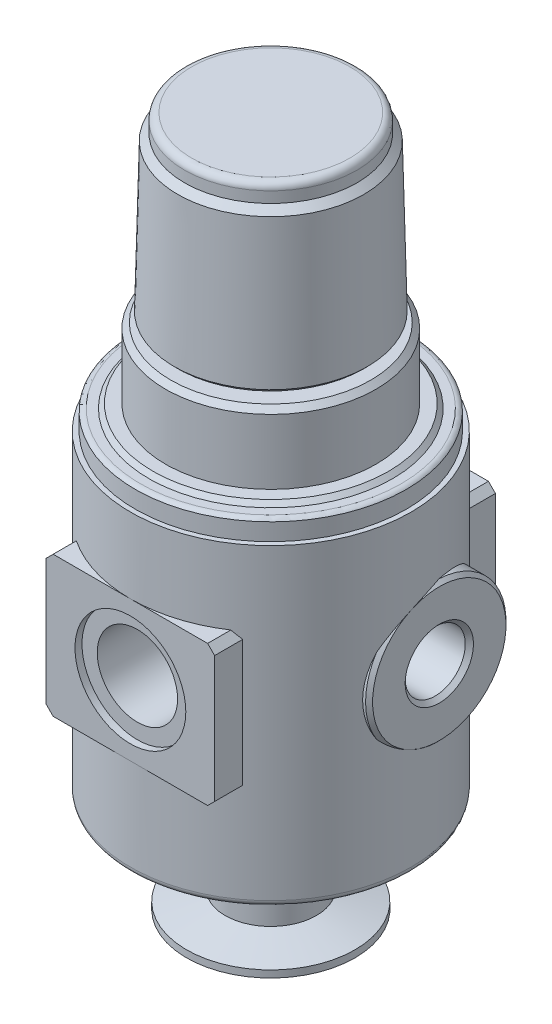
ISO-10303-21;
HEADER;
FILE_DESCRIPTION(('STEP AP214'),'2;1');
FILE_NAME('part.step','',(''),(''),'','','');
FILE_SCHEMA(('AUTOMOTIVE_DESIGN { 1 0 10303 214 1 1 1 1 }'));
ENDSEC;
DATA;
#1=APPLICATION_CONTEXT('core data for automotive mechanical design processes');
#2=APPLICATION_PROTOCOL_DEFINITION('international standard','automotive_design',2000,#1);
#3=PRODUCT_CONTEXT('',#1,'mechanical');
#4=PRODUCT('Part','Part','',(#3));
#5=PRODUCT_RELATED_PRODUCT_CATEGORY('part','',(#4));
#6=PRODUCT_DEFINITION_FORMATION('','',#4);
#7=PRODUCT_DEFINITION_CONTEXT('part definition',#1,'design');
#8=PRODUCT_DEFINITION('design','',#6,#7);
#9=PRODUCT_DEFINITION_SHAPE('','',#8);
#10=(LENGTH_UNIT() NAMED_UNIT(*) SI_UNIT(.MILLI.,.METRE.));
#11=(NAMED_UNIT(*) PLANE_ANGLE_UNIT() SI_UNIT($,.RADIAN.));
#12=(NAMED_UNIT(*) SI_UNIT($,.STERADIAN.) SOLID_ANGLE_UNIT());
#13=UNCERTAINTY_MEASURE_WITH_UNIT(LENGTH_MEASURE(1.E-05),#10,'distance_accuracy_value','');
#14=(GEOMETRIC_REPRESENTATION_CONTEXT(3) GLOBAL_UNCERTAINTY_ASSIGNED_CONTEXT((#13)) GLOBAL_UNIT_ASSIGNED_CONTEXT((#10,
#11,#12)) REPRESENTATION_CONTEXT('',''));
#15=CARTESIAN_POINT('',(0.,0.,0.));
#16=DIRECTION('',(0.,0.,1.));
#17=DIRECTION('',(1.,0.,0.));
#18=AXIS2_PLACEMENT_3D('',#15,#16,#17);
#19=CARTESIAN_POINT('',(0.,84.0000000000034,0.));
#20=DIRECTION('',(0.,-1.,0.));
#21=DIRECTION('',(1.,0.,0.));
#22=AXIS2_PLACEMENT_3D('',#19,#20,#21);
#23=CYLINDRICAL_SURFACE('',#22,20.);
#24=CARTESIAN_POINT('',(0.,14.,0.));
#25=DIRECTION('',(0.,1.,0.));
#26=DIRECTION('',(0.,0.,1.));
#27=AXIS2_PLACEMENT_3D('',#24,#25,#26);
#28=CIRCLE('',#27,20.);
#29=CARTESIAN_POINT('',(0.,14.,20.));
#30=VERTEX_POINT('',#29);
#31=CARTESIAN_POINT('',(11.,14.,16.7032930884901));
#32=VERTEX_POINT('',#31);
#33=EDGE_CURVE('E50',#30,#32,#28,.T.);
#34=ORIENTED_EDGE('',*,*,#33,.F.);
#35=CARTESIAN_POINT('',(-11.,14.,16.7032930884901));
#36=VERTEX_POINT('',#35);
#37=EDGE_CURVE('E473',#36,#30,#28,.T.);
#38=ORIENTED_EDGE('',*,*,#37,.F.);
#39=CARTESIAN_POINT('',(0.,3.00000000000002,0.));
#40=DIRECTION('',(0.707106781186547,0.707106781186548,0.));
#41=DIRECTION('',(0.707106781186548,-0.707106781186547,0.));
#42=AXIS2_PLACEMENT_3D('',#39,#40,#41);
#43=ELLIPSE('',#42,28.2842712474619,20.);
#44=CARTESIAN_POINT('',(-12.,15.,16.));
#45=VERTEX_POINT('',#44);
#46=EDGE_CURVE('E476',#45,#36,#43,.T.);
#47=ORIENTED_EDGE('',*,*,#46,.F.);
#48=DIRECTION('',(0.,-1.,0.));
#49=VECTOR('',#48,1.);
#50=CARTESIAN_POINT('',(-12.,84.0000000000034,16.));
#51=LINE('',#50,#49);
#52=CARTESIAN_POINT('',(-12.,33.,16.));
#53=VERTEX_POINT('',#52);
#54=EDGE_CURVE('E481',#53,#45,#51,.T.);
#55=ORIENTED_EDGE('',*,*,#54,.F.);
#56=CARTESIAN_POINT('',(0.,45.,0.));
#57=DIRECTION('',(0.707106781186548,-0.707106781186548,0.));
#58=DIRECTION('',(-0.707106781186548,-0.707106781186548,0.));
#59=AXIS2_PLACEMENT_3D('',#56,#57,#58);
#60=ELLIPSE('',#59,28.2842712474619,20.);
#61=CARTESIAN_POINT('',(-11.,34.,16.7032930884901));
#62=VERTEX_POINT('',#61);
#63=EDGE_CURVE('E480',#62,#53,#60,.T.);
#64=ORIENTED_EDGE('',*,*,#63,.F.);
#65=CARTESIAN_POINT('',(0.,34.,0.));
#66=DIRECTION('',(0.,-1.,0.));
#67=DIRECTION('',(0.,0.,-1.));
#68=AXIS2_PLACEMENT_3D('',#65,#66,#67);
#69=CIRCLE('',#68,20.);
#70=CARTESIAN_POINT('',(0.,34.,20.));
#71=VERTEX_POINT('',#70);
#72=EDGE_CURVE('E469',#71,#62,#69,.T.);
#73=ORIENTED_EDGE('',*,*,#72,.F.);
#74=CARTESIAN_POINT('',(11.,34.,16.7032930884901));
#75=VERTEX_POINT('',#74);
#76=EDGE_CURVE('E488',#75,#71,#69,.T.);
#77=ORIENTED_EDGE('',*,*,#76,.F.);
#78=CARTESIAN_POINT('',(0.,45.,0.));
#79=DIRECTION('',(-0.707106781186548,-0.707106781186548,0.));
#80=DIRECTION('',(0.707106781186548,-0.707106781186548,0.));
#81=AXIS2_PLACEMENT_3D('',#78,#79,#80);
#82=ELLIPSE('',#81,28.2842712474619,20.);
#83=CARTESIAN_POINT('',(12.,33.,16.));
#84=VERTEX_POINT('',#83);
#85=EDGE_CURVE('E484',#84,#75,#82,.T.);
#86=ORIENTED_EDGE('',*,*,#85,.F.);
#87=DIRECTION('',(0.,-1.,0.));
#88=VECTOR('',#87,1.);
#89=CARTESIAN_POINT('',(12.,84.0000000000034,16.));
#90=LINE('',#89,#88);
#91=CARTESIAN_POINT('',(12.,15.,16.));
#92=VERTEX_POINT('',#91);
#93=EDGE_CURVE('E487',#92,#84,#90,.F.);
#94=ORIENTED_EDGE('',*,*,#93,.F.);
#95=CARTESIAN_POINT('',(0.,3.00000000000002,0.));
#96=DIRECTION('',(-0.707106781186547,0.707106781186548,0.));
#97=DIRECTION('',(-0.707106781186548,-0.707106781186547,0.));
#98=AXIS2_PLACEMENT_3D('',#95,#96,#97);
#99=ELLIPSE('',#98,28.2842712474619,20.);
#100=EDGE_CURVE('E491',#32,#92,#99,.T.);
#101=ORIENTED_EDGE('',*,*,#100,.F.);
#102=EDGE_LOOP('',(#34,#38,#47,#55,#64,#73,#77,#86,#94,#101));
#103=FACE_BOUND('',#102,.T.);
#104=CARTESIAN_POINT('',(0.,0.899999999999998,0.));
#105=DIRECTION('',(0.,-1.,0.));
#106=DIRECTION('',(1.,0.,0.));
#107=AXIS2_PLACEMENT_3D('',#104,#105,#106);
#108=CIRCLE('',#107,20.);
#109=CARTESIAN_POINT('',(20.,0.9,0.));
#110=VERTEX_POINT('',#109);
#111=EDGE_CURVE('E366',#110,#110,#108,.T.);
#112=ORIENTED_EDGE('',*,*,#111,.F.);
#113=EDGE_LOOP('',(#112));
#114=FACE_BOUND('',#113,.T.);
#115=CARTESIAN_POINT('',(0.,44.7,0.));
#116=DIRECTION('',(0.,-1.,0.));
#117=DIRECTION('',(1.,0.,0.));
#118=AXIS2_PLACEMENT_3D('',#115,#116,#117);
#119=CIRCLE('',#118,20.);
#120=CARTESIAN_POINT('',(20.,44.7,0.));
#121=VERTEX_POINT('',#120);
#122=EDGE_CURVE('E363',#121,#121,#119,.T.);
#123=ORIENTED_EDGE('',*,*,#122,.T.);
#124=EDGE_LOOP('',(#123));
#125=FACE_BOUND('',#124,.T.);
#126=CARTESIAN_POINT('',(19.4498,34.0285781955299,-4.6588925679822));
#127=CARTESIAN_POINT('',(19.4968274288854,33.9943624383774,-4.46258987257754));
#128=CARTESIAN_POINT('',(19.5407737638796,33.9576151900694,-4.26597959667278));
#129=CARTESIAN_POINT('',(19.6225266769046,33.878600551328,-3.87256441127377));
#130=CARTESIAN_POINT('',(19.6603324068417,33.8363323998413,-3.67575947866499));
#131=CARTESIAN_POINT('',(19.7298420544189,33.7457908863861,-3.28226868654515));
#132=CARTESIAN_POINT('',(19.761540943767,33.6975126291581,-3.08558305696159));
#133=CARTESIAN_POINT('',(19.8188566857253,33.5946179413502,-2.69300876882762));
#134=CARTESIAN_POINT('',(19.8444738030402,33.540001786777,-2.49712007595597));
#135=CARTESIAN_POINT('',(19.9125599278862,33.365558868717,-1.909403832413));
#136=CARTESIAN_POINT('',(19.9459297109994,33.2355673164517,-1.51943318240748));
#137=CARTESIAN_POINT('',(19.9896877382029,32.9468834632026,-0.749147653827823));
#138=CARTESIAN_POINT('',(20.0000855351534,32.7882031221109,-0.368828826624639));
#139=CARTESIAN_POINT('',(19.9999158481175,32.4461336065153,0.367436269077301));
#140=CARTESIAN_POINT('',(19.9899360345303,32.2635752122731,0.723768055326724));
#141=CARTESIAN_POINT('',(19.9525922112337,31.8701587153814,1.41969581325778));
#142=CARTESIAN_POINT('',(19.9252217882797,31.6592901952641,1.75928556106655));
#143=CARTESIAN_POINT('',(19.8562563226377,31.2105152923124,2.41611880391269));
#144=CARTESIAN_POINT('',(19.8147314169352,30.9727460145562,2.7334633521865));
#145=CARTESIAN_POINT('',(19.7209550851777,30.4696712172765,3.34350077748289));
#146=CARTESIAN_POINT('',(19.6687133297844,30.2043906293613,3.63621554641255));
#147=CARTESIAN_POINT('',(19.5870810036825,29.7942601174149,4.04525905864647));
#148=CARTESIAN_POINT('',(19.5602434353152,29.66004696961,4.17289235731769));
#149=CARTESIAN_POINT('',(19.5056143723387,29.3855623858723,4.42121921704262));
#150=CARTESIAN_POINT('',(19.4778229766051,29.2452915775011,4.54191349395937));
#151=CARTESIAN_POINT('',(19.4497999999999,29.1019701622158,4.65889256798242));
#152=B_SPLINE_CURVE_WITH_KNOTS('',3,(#126,#127,#128,#129,#130,#131,#132,#133,#134,#135,#136,
#137,#138,#139,#140,#141,#142,#143,#144,#145,#146,#147,#148,#149,#150,#151),.UNSPECIFIED.,.F.,
.F.,(4,2,2,2,2,2,2,2,2,2,2,2,4),(0.,0.61418501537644,1.22845478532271,1.84322819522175,
2.45797484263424,3.69339730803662,4.92830592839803,6.12810417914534,7.32834514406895,
8.52272321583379,9.71602820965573,10.2772698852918,10.8384535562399),.UNSPECIFIED.);
#153=CARTESIAN_POINT('',(19.5,33.9901340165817,-4.44409720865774));
#154=VERTEX_POINT('',#153);
#155=CARTESIAN_POINT('',(20.,32.6168439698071,0.));
#156=VERTEX_POINT('',#155);
#157=EDGE_CURVE('E451',#154,#156,#152,.T.);
#158=ORIENTED_EDGE('',*,*,#157,.F.);
#159=CARTESIAN_POINT('',(20.,33.1651513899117,0.));
#160=CARTESIAN_POINT('',(20.0000010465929,33.0552684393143,0.251776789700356));
#161=CARTESIAN_POINT('',(19.9952372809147,32.9350077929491,0.499001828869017));
#162=CARTESIAN_POINT('',(19.977315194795,32.6746440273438,0.982567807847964));
#163=CARTESIAN_POINT('',(19.9641537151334,32.5345334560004,1.21890461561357));
#164=CARTESIAN_POINT('',(19.9307191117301,32.2354067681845,1.67921930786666));
#165=CARTESIAN_POINT('',(19.9104360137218,32.0763643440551,1.90317934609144));
#166=CARTESIAN_POINT('',(19.8641911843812,31.7406602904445,2.33698943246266));
#167=CARTESIAN_POINT('',(19.8382271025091,31.5639913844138,2.54683359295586));
#168=CARTESIAN_POINT('',(19.7822453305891,31.1950111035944,2.95027152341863));
#169=CARTESIAN_POINT('',(19.7522427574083,31.0027590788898,3.1439217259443));
#170=CARTESIAN_POINT('',(19.6896368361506,30.6032266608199,3.51476689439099));
#171=CARTESIAN_POINT('',(19.6570323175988,30.3959395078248,3.69195437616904));
#172=CARTESIAN_POINT('',(19.5907942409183,29.9677908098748,4.02867451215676));
#173=CARTESIAN_POINT('',(19.5571611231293,29.746935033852,4.18821458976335));
#174=CARTESIAN_POINT('',(19.4903710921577,29.2928958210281,4.48877958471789));
#175=CARTESIAN_POINT('',(19.45721418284,29.0597122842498,4.62980435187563));
#176=CARTESIAN_POINT('',(19.3916372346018,28.5735000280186,4.89735523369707));
#177=CARTESIAN_POINT('',(19.3592907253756,28.3200555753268,5.02314501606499));
#178=CARTESIAN_POINT('',(19.2982190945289,27.8031503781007,5.25289189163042));
#179=CARTESIAN_POINT('',(19.2694925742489,27.5396935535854,5.35685742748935));
#180=CARTESIAN_POINT('',(19.2170074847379,27.004454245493,5.54219359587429));
#181=CARTESIAN_POINT('',(19.1932489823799,26.7326716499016,5.62356392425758));
#182=CARTESIAN_POINT('',(19.1518447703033,26.1827356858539,5.76299767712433));
#183=CARTESIAN_POINT('',(19.1341988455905,25.9045825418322,5.82106192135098));
#184=CARTESIAN_POINT('',(19.1061899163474,25.3501025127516,5.91233777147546));
#185=CARTESIAN_POINT('',(19.0956766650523,25.0738677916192,5.94606310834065));
#186=CARTESIAN_POINT('',(19.081822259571,24.5193679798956,5.99037588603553));
#187=CARTESIAN_POINT('',(19.0784810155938,24.2411029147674,6.0009636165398));
#188=CARTESIAN_POINT('',(19.0791303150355,23.6847073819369,5.99889878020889));
#189=CARTESIAN_POINT('',(19.0831198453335,23.4065769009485,5.98624942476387));
#190=CARTESIAN_POINT('',(19.098238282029,22.8525356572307,5.93783928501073));
#191=CARTESIAN_POINT('',(19.1093670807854,22.5766248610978,5.90207884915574));
#192=CARTESIAN_POINT('',(19.1377517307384,22.0382480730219,5.80936454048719));
#193=CARTESIAN_POINT('',(19.1547901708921,21.7756410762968,5.75315963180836));
#194=CARTESIAN_POINT('',(19.1942964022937,21.2561870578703,5.61994719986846));
#195=CARTESIAN_POINT('',(19.2167640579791,20.9993398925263,5.54294019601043));
#196=CARTESIAN_POINT('',(19.266163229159,20.4930380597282,5.36871904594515));
#197=CARTESIAN_POINT('',(19.2930948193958,20.2435835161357,5.2715045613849));
#198=CARTESIAN_POINT('',(19.35029004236,19.7534947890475,5.05752280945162));
#199=CARTESIAN_POINT('',(19.3805549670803,19.5128640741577,4.94074795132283));
#200=CARTESIAN_POINT('',(19.4440969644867,19.0346846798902,4.68455297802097));
#201=CARTESIAN_POINT('',(19.4774380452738,18.7974583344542,4.54454691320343));
#202=CARTESIAN_POINT('',(19.5448147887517,18.3353201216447,4.24543509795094));
#203=CARTESIAN_POINT('',(19.5788507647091,18.1104139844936,4.0863205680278));
#204=CARTESIAN_POINT('',(19.646046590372,17.6743518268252,3.74996857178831));
#205=CARTESIAN_POINT('',(19.6792062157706,17.4631993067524,3.57272652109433));
#206=CARTESIAN_POINT('',(19.7430292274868,17.0561359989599,3.20129390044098));
#207=CARTESIAN_POINT('',(19.7736937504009,16.8602182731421,3.00711113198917));
#208=CARTESIAN_POINT('',(19.8317492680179,16.4795875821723,2.59725457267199));
#209=CARTESIAN_POINT('',(19.8590253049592,16.2953386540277,2.38113285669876));
#210=CARTESIAN_POINT('',(19.9075754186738,15.9456704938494,1.93366342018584));
#211=CARTESIAN_POINT('',(19.9288520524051,15.7802432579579,1.70232223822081));
#212=CARTESIAN_POINT('',(19.9638148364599,15.4694863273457,1.22600979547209));
#213=CARTESIAN_POINT('',(19.9775022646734,15.3241532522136,0.981040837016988));
#214=CARTESIAN_POINT('',(19.9958303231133,15.0547970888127,0.479329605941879));
#215=CARTESIAN_POINT('',(20.0004715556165,14.9307725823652,0.222588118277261));
#216=CARTESIAN_POINT('',(19.9994785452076,14.7108709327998,-0.287163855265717));
#217=CARTESIAN_POINT('',(19.9943571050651,14.6138795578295,-0.539694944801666));
#218=CARTESIAN_POINT('',(19.9739848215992,14.440773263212,-1.0514190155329));
#219=CARTESIAN_POINT('',(19.9587343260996,14.3646576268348,-1.31061176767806));
#220=CARTESIAN_POINT('',(19.9175136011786,14.2338104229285,-1.83340656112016));
#221=CARTESIAN_POINT('',(19.8915471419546,14.1790713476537,-2.09700702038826));
#222=CARTESIAN_POINT('',(19.8285835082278,14.0911443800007,-2.62646851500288));
#223=CARTESIAN_POINT('',(19.7915866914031,14.0579557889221,-2.89232947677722));
#224=CARTESIAN_POINT('',(19.7089924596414,14.0143213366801,-3.40881984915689));
#225=CARTESIAN_POINT('',(19.6640102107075,14.0026799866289,-3.65944808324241));
#226=CARTESIAN_POINT('',(19.5644580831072,13.9981445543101,-4.15894531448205));
#227=CARTESIAN_POINT('',(19.5098886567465,14.0052495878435,-4.40781439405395));
#228=CARTESIAN_POINT('',(19.3915768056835,14.0376986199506,-4.90217942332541));
#229=CARTESIAN_POINT('',(19.3278332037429,14.0630449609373,-5.14767493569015));
#230=CARTESIAN_POINT('',(19.1917720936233,14.1313132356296,-5.6337910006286));
#231=CARTESIAN_POINT('',(19.1194542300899,14.1742358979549,-5.87441135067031));
#232=CARTESIAN_POINT('',(18.9640810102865,14.2788349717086,-6.35851280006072));
#233=CARTESIAN_POINT('',(18.8807222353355,14.341161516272,-6.60175567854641));
#234=CARTESIAN_POINT('',(18.7064920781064,14.4829908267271,-7.08039766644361));
#235=CARTESIAN_POINT('',(18.6156205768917,14.5624938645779,-7.31579665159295));
#236=CARTESIAN_POINT('',(18.427378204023,14.7377445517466,-7.77778613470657));
#237=CARTESIAN_POINT('',(18.3300069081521,14.8334932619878,-8.0043760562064));
#238=CARTESIAN_POINT('',(18.1298405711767,15.0403396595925,-8.44796486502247));
#239=CARTESIAN_POINT('',(18.0270448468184,15.1514392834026,-8.66496253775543));
#240=CARTESIAN_POINT('',(17.8033916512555,15.4036817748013,-9.1165103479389));
#241=CARTESIAN_POINT('',(17.6819333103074,15.5468538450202,-9.34963090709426));
#242=CARTESIAN_POINT('',(17.435213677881,15.8507206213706,-9.80202665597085));
#243=CARTESIAN_POINT('',(17.3099520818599,16.0114167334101,-10.0213007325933));
#244=CARTESIAN_POINT('',(17.0571979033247,16.3497420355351,-10.4457215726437));
#245=CARTESIAN_POINT('',(16.9297019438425,16.5273990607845,-10.6508441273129));
#246=CARTESIAN_POINT('',(16.6745957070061,16.8987325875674,-11.0459570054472));
#247=CARTESIAN_POINT('',(16.5469854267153,17.0924095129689,-11.2359469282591));
#248=CARTESIAN_POINT('',(16.2771134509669,17.5217091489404,-11.6240480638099));
#249=CARTESIAN_POINT('',(16.1351244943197,17.7595020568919,-11.8199579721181));
#250=CARTESIAN_POINT('',(15.8570181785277,18.2544744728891,-12.190514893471));
#251=CARTESIAN_POINT('',(15.7209023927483,18.5116591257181,-12.3651562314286));
#252=CARTESIAN_POINT('',(15.4587797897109,19.0443792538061,-12.6913283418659));
#253=CARTESIAN_POINT('',(15.3327537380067,19.3198778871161,-12.8429036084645));
#254=CARTESIAN_POINT('',(15.0951410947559,19.8889291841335,-13.1213644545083));
#255=CARTESIAN_POINT('',(14.9835452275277,20.1824700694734,-13.2482659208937));
#256=CARTESIAN_POINT('',(14.8156362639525,20.6804527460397,-13.435279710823));
#257=CARTESIAN_POINT('',(14.753653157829,20.8800773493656,-13.503214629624));
#258=CARTESIAN_POINT('',(14.6394597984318,21.2857602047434,-13.6269330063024));
#259=CARTESIAN_POINT('',(14.5872465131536,21.4918164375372,-13.6827202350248));
#260=CARTESIAN_POINT('',(14.4941136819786,21.909222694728,-13.7813378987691));
#261=CARTESIAN_POINT('',(14.4531789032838,22.1205651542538,-13.824185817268));
#262=CARTESIAN_POINT('',(14.3838249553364,22.5476026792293,-13.8963338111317));
#263=CARTESIAN_POINT('',(14.355405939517,22.7632977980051,-13.925633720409));
#264=CARTESIAN_POINT('',(14.3119630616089,23.1988962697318,-13.9702791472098));
#265=CARTESIAN_POINT('',(14.2970263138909,23.4188177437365,-13.9855339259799));
#266=CARTESIAN_POINT('',(14.2814415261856,23.8596975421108,-14.0014483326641));
#267=CARTESIAN_POINT('',(14.2807933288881,24.0806558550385,-14.0021081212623));
#268=CARTESIAN_POINT('',(14.2938125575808,24.5217610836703,-13.9888171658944));
#269=CARTESIAN_POINT('',(14.3074837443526,24.7419077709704,-13.9748625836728));
#270=CARTESIAN_POINT('',(14.3486147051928,25.1795044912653,-13.9326278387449));
#271=CARTESIAN_POINT('',(14.3760744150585,25.3969545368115,-13.9043477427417));
#272=CARTESIAN_POINT('',(14.4410540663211,25.8102372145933,-13.8368332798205));
#273=CARTESIAN_POINT('',(14.477586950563,26.0064015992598,-13.7986632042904));
#274=CARTESIAN_POINT('',(14.5604394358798,26.3941572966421,-13.7112081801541));
#275=CARTESIAN_POINT('',(14.6067626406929,26.5857468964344,-13.6619191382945));
#276=CARTESIAN_POINT('',(14.7587510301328,27.1525697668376,-13.4982013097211));
#277=CARTESIAN_POINT('',(14.8774426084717,27.5199027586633,-13.3679141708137));
#278=CARTESIAN_POINT('',(15.1064937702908,28.1387854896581,-13.1078505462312));
#279=CARTESIAN_POINT('',(15.2113089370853,28.3960409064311,-12.9863540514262));
#280=CARTESIAN_POINT('',(15.4313959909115,28.8959855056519,-12.7240452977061));
#281=CARTESIAN_POINT('',(15.5466721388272,29.1386686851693,-12.583225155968));
#282=CARTESIAN_POINT('',(15.7846298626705,29.6091980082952,-12.2834094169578));
#283=CARTESIAN_POINT('',(15.9073219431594,29.8370221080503,-12.1243877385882));
#284=CARTESIAN_POINT('',(16.1571859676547,30.277127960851,-11.7893600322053));
#285=CARTESIAN_POINT('',(16.2843574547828,30.4894112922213,-11.6133557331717));
#286=CARTESIAN_POINT('',(16.5432036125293,30.9019610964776,-11.2416492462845));
#287=CARTESIAN_POINT('',(16.6749179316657,31.1019224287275,-11.045636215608));
#288=CARTESIAN_POINT('',(16.9382518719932,31.4848538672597,-10.6374174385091));
#289=CARTESIAN_POINT('',(17.0698714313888,31.667816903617,-10.4252050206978));
#290=CARTESIAN_POINT('',(17.3308582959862,32.0158914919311,-9.98532643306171));
#291=CARTESIAN_POINT('',(17.4602257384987,32.1810041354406,-9.75766120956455));
#292=CARTESIAN_POINT('',(17.7146966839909,32.4923442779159,-9.28767503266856));
#293=CARTESIAN_POINT('',(17.8398020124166,32.6385799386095,-9.04536048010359));
#294=CARTESIAN_POINT('',(18.0958623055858,32.9243735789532,-8.52247251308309));
#295=CARTESIAN_POINT('',(18.226197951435,33.0618896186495,-8.24047254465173));
#296=CARTESIAN_POINT('',(18.4772139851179,33.3110627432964,-7.66108562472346));
#297=CARTESIAN_POINT('',(18.5978934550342,33.4227173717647,-7.36369721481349));
#298=CARTESIAN_POINT('',(18.8273038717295,33.6181381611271,-6.75560181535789));
#299=CARTESIAN_POINT('',(18.9360412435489,33.7019193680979,-6.44490211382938));
#300=CARTESIAN_POINT('',(19.1396075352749,33.8396813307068,-5.81254338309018));
#301=CARTESIAN_POINT('',(19.2344397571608,33.8936691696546,-5.49088697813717));
#302=CARTESIAN_POINT('',(19.3973521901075,33.9651707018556,-4.88150446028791));
#303=CARTESIAN_POINT('',(19.4673036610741,33.9864753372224,-4.59471983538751));
#304=CARTESIAN_POINT('',(19.5945527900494,34.0041502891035,-4.01756038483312));
#305=CARTESIAN_POINT('',(19.6518504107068,34.0005205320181,-3.72718554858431));
#306=CARTESIAN_POINT('',(19.7531941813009,33.967718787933,-3.14612959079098));
#307=CARTESIAN_POINT('',(19.7972654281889,33.9385955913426,-2.85545011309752));
#308=CARTESIAN_POINT('',(19.8721920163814,33.8546543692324,-2.27623051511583));
#309=CARTESIAN_POINT('',(19.9030531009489,33.7998475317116,-1.98768951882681));
#310=CARTESIAN_POINT('',(19.9523018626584,33.6636423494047,-1.4109428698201));
#311=CARTESIAN_POINT('',(19.9704815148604,33.5818315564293,-1.12281684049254));
#312=CARTESIAN_POINT('',(19.9943290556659,33.3925104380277,-0.554656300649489));
#313=CARTESIAN_POINT('',(19.9999988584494,33.2850040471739,-0.274620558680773));
#314=CARTESIAN_POINT('',(20.,33.1651513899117,0.));
#315=B_SPLINE_CURVE_WITH_KNOTS('',3,(#159,#160,#161,#162,#163,#164,#165,#166,#167,#168,#169,
#170,#171,#172,#173,#174,#175,#176,#177,#178,#179,#180,#181,#182,#183,#184,#185,#186,#187,#188,
#189,#190,#191,#192,#193,#194,#195,#196,#197,#198,#199,#200,#201,#202,#203,#204,#205,#206,#207,
#208,#209,#210,#211,#212,#213,#214,#215,#216,#217,#218,#219,#220,#221,#222,#223,#224,#225,#226,
#227,#228,#229,#230,#231,#232,#233,#234,#235,#236,#237,#238,#239,#240,#241,#242,#243,#244,#245,
#246,#247,#248,#249,#250,#251,#252,#253,#254,#255,#256,#257,#258,#259,#260,#261,#262,#263,#264,
#265,#266,#267,#268,#269,#270,#271,#272,#273,#274,#275,#276,#277,#278,#279,#280,#281,#282,#283,
#284,#285,#286,#287,#288,#289,#290,#291,#292,#293,#294,#295,#296,#297,#298,#299,#300,#301,#302,
#303,#304,#305,#306,#307,#308,#309,#310,#311,#312,#313,#314),.UNSPECIFIED.,.T.,.F.,(4,2,2,2,2,2,
2,2,2,2,2,2,2,2,2,2,2,2,2,2,2,2,2,2,2,2,2,2,2,2,2,2,2,2,2,2,2,2,2,2,2,2,2,2,2,2,2,2,2,2,2,2,2,2,
2,2,2,2,2,2,2,2,2,2,2,2,2,2,2,2,2,2,2,2,2,2,2,4),(0.,0.823832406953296,1.64797492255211,
2.47327633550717,3.29891986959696,4.12155461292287,4.94456152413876,5.76722090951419,
6.58988696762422,7.44321631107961,8.29621493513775,9.1492250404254,10.0022051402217,
10.8366079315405,11.671000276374,12.5052773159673,13.3395417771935,14.1458989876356,
14.9522360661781,15.7585866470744,16.565250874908,17.3967213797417,18.22857538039,
19.0606402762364,19.8923239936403,20.7471710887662,21.601653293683,22.4559915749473,
23.3102729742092,24.1209140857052,24.9315273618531,25.741855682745,26.5521577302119,
27.3159739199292,28.0797540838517,28.8436323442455,29.6075422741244,30.400454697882,
31.1933796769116,31.9863564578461,32.7794333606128,33.6765052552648,34.5736491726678,
35.4722915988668,36.3709578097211,37.3874522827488,38.404217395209,39.4189956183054,
40.4331182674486,41.0919226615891,41.7505222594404,42.4082279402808,43.065941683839,
43.7278753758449,44.3898017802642,45.0519020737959,45.71399928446,46.322831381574,
46.9318879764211,48.1498617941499,49.0583943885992,49.9672987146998,50.8775221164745,
51.7876529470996,52.7150846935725,53.6429004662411,54.5706594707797,55.4980159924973,
56.5158085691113,57.533697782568,58.5510366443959,59.5681335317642,60.4547370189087,
61.3413431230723,62.2262561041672,63.110783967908,64.0095004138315,64.9080793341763),.UNSPECIFIED.);
#316=CARTESIAN_POINT('',(19.5,14.0098659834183,-4.44409720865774));
#317=VERTEX_POINT('',#316);
#318=EDGE_CURVE('E441',#317,#154,#315,.T.);
#319=ORIENTED_EDGE('',*,*,#318,.F.);
#320=CARTESIAN_POINT('',(19.4497999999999,18.8980298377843,4.6588925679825));
#321=CARTESIAN_POINT('',(19.4748919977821,18.7696929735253,4.55414703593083));
#322=CARTESIAN_POINT('',(19.4998004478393,18.6437988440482,4.44641579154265));
#323=CARTESIAN_POINT('',(19.5488890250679,18.396895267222,4.22536894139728));
#324=CARTESIAN_POINT('',(19.5730692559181,18.2758851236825,4.11205413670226));
#325=CARTESIAN_POINT('',(19.6439469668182,17.920324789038,3.76446335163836));
#326=CARTESIAN_POINT('',(19.6890248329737,17.6930290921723,3.52236371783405));
#327=CARTESIAN_POINT('',(19.7721086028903,17.258965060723,3.02125522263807));
#328=CARTESIAN_POINT('',(19.8101444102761,17.052111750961,2.76232447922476));
#329=CARTESIAN_POINT('',(19.8772293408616,16.6578390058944,2.22890430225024));
#330=CARTESIAN_POINT('',(19.9062769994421,16.4704227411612,1.9544123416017));
#331=CARTESIAN_POINT('',(19.9538951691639,16.1120623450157,1.38724875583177));
#332=CARTESIAN_POINT('',(19.9722739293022,15.9414628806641,1.09434341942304));
#333=CARTESIAN_POINT('',(19.9960534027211,15.620530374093,0.497137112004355));
#334=CARTESIAN_POINT('',(20.0014542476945,15.4701971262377,0.192836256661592));
#335=CARTESIAN_POINT('',(19.9978716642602,15.1894675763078,-0.425057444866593));
#336=CARTESIAN_POINT('',(19.9888753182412,15.0590892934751,-0.738658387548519));
#337=CARTESIAN_POINT('',(19.9553762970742,14.8179292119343,-1.37244627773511));
#338=CARTESIAN_POINT('',(19.9308760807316,14.707144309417,-1.69263217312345));
#339=CARTESIAN_POINT('',(19.8761098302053,14.5368652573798,-2.23351911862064));
#340=CARTESIAN_POINT('',(19.8502303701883,14.4723325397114,-2.45310710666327));
#341=CARTESIAN_POINT('',(19.7908347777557,14.3514389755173,-2.89347628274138));
#342=CARTESIAN_POINT('',(19.7573195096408,14.2950772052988,-3.11425733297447));
#343=CARTESIAN_POINT('',(19.6826356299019,14.1901421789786,-3.55582054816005));
#344=CARTESIAN_POINT('',(19.6414845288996,14.1415515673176,-3.77660157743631));
#345=CARTESIAN_POINT('',(19.5514495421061,14.0513832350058,-4.21801654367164));
#346=CARTESIAN_POINT('',(19.5025658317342,14.0098053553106,-4.43865048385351));
#347=CARTESIAN_POINT('',(19.4498,13.9714218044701,-4.65889256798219));
#348=B_SPLINE_CURVE_WITH_KNOTS('',3,(#320,#321,#322,#323,#324,#325,#326,#327,#328,#329,#330,
#331,#332,#333,#334,#335,#336,#337,#338,#339,#340,#341,#342,#343,#344,#345,#346,#347),
.UNSPECIFIED.,.F.,.F.,(4,2,2,2,2,2,2,2,2,2,2,2,2,4),(0.,0.502535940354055,1.0049999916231,
2.00908357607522,3.00880036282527,4.00867996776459,5.02601440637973,6.04333852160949,
7.0615759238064,8.07965188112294,8.77039436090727,9.46105869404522,10.1501583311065,
10.839242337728),.UNSPECIFIED.);
#349=CARTESIAN_POINT('',(20.,15.383156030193,0.));
#350=VERTEX_POINT('',#349);
#351=EDGE_CURVE('E402',#350,#317,#348,.T.);
#352=ORIENTED_EDGE('',*,*,#351,.F.);
#353=CARTESIAN_POINT('',(19.5,18.6430211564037,4.44409720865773));
#354=VERTEX_POINT('',#353);
#355=EDGE_CURVE('E411',#354,#350,#348,.T.);
#356=ORIENTED_EDGE('',*,*,#355,.F.);
#357=CARTESIAN_POINT('',(19.5,29.3569788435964,4.4440972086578));
#358=VERTEX_POINT('',#357);
#359=EDGE_CURVE('E683',#358,#354,#315,.T.);
#360=ORIENTED_EDGE('',*,*,#359,.F.);
#361=EDGE_CURVE('E410',#156,#358,#152,.T.);
#362=ORIENTED_EDGE('',*,*,#361,.F.);
#363=EDGE_LOOP('',(#158,#319,#352,#356,#360,#362));
#364=FACE_BOUND('',#363,.T.);
#365=CARTESIAN_POINT('',(-19.4497999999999,29.1019701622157,4.65889256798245));
#366=CARTESIAN_POINT('',(-19.4748919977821,29.2303070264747,4.55414703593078));
#367=CARTESIAN_POINT('',(-19.4998004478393,29.3562011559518,4.44641579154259));
#368=CARTESIAN_POINT('',(-19.5488890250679,29.6031047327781,4.22536894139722));
#369=CARTESIAN_POINT('',(-19.5730692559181,29.7241148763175,4.1120541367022));
#370=CARTESIAN_POINT('',(-19.6439469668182,30.079675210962,3.7644633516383));
#371=CARTESIAN_POINT('',(-19.6890248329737,30.3069709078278,3.52236371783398));
#372=CARTESIAN_POINT('',(-19.7721086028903,30.741034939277,3.02125522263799));
#373=CARTESIAN_POINT('',(-19.8101444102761,30.9478882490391,2.76232447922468));
#374=CARTESIAN_POINT('',(-19.8772293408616,31.3421609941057,2.22890430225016));
#375=CARTESIAN_POINT('',(-19.9062769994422,31.5295772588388,1.95441234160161));
#376=CARTESIAN_POINT('',(-19.9538951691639,31.8879376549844,1.38724875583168));
#377=CARTESIAN_POINT('',(-19.9722739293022,32.0585371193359,1.09434341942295));
#378=CARTESIAN_POINT('',(-19.9960534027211,32.379469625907,0.497137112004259));
#379=CARTESIAN_POINT('',(-20.0014542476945,32.5298028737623,0.192836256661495));
#380=CARTESIAN_POINT('',(-19.9978716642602,32.8105324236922,-0.425057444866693));
#381=CARTESIAN_POINT('',(-19.9888753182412,32.9409107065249,-0.738658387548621));
#382=CARTESIAN_POINT('',(-19.9553762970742,33.1820707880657,-1.37244627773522));
#383=CARTESIAN_POINT('',(-19.9308760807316,33.292855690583,-1.69263217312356));
#384=CARTESIAN_POINT('',(-19.8761098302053,33.4631347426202,-2.23351911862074));
#385=CARTESIAN_POINT('',(-19.8502303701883,33.5276674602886,-2.45310710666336));
#386=CARTESIAN_POINT('',(-19.7908347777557,33.6485610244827,-2.89347628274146));
#387=CARTESIAN_POINT('',(-19.7573195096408,33.7049227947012,-3.11425733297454));
#388=CARTESIAN_POINT('',(-19.6826356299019,33.8098578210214,-3.55582054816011));
#389=CARTESIAN_POINT('',(-19.6414845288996,33.8584484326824,-3.77660157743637));
#390=CARTESIAN_POINT('',(-19.5514495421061,33.9486167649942,-4.21801654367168));
#391=CARTESIAN_POINT('',(-19.5025658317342,33.9901946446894,-4.43865048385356));
#392=CARTESIAN_POINT('',(-19.4498,34.0285781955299,-4.65889256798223));
#393=B_SPLINE_CURVE_WITH_KNOTS('',3,(#365,#366,#367,#368,#369,#370,#371,#372,#373,#374,#375,
#376,#377,#378,#379,#380,#381,#382,#383,#384,#385,#386,#387,#388,#389,#390,#391,#392),
.UNSPECIFIED.,.F.,.F.,(4,2,2,2,2,2,2,2,2,2,2,2,2,4),(0.,0.502535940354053,1.0049999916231,
2.00908357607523,3.00880036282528,4.0086799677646,5.02601440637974,6.04333852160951,
7.06157592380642,8.07965188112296,8.77039436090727,9.4610586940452,10.1501583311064,
10.839242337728),.UNSPECIFIED.);
#394=CARTESIAN_POINT('',(-20.,32.6168439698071,0.));
#395=VERTEX_POINT('',#394);
#396=CARTESIAN_POINT('',(-19.5,33.9901340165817,-4.44409720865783));
#397=VERTEX_POINT('',#396);
#398=EDGE_CURVE('E465',#395,#397,#393,.T.);
#399=ORIENTED_EDGE('',*,*,#398,.F.);
#400=CARTESIAN_POINT('',(-19.5,29.3569788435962,4.44409720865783));
#401=VERTEX_POINT('',#400);
#402=EDGE_CURVE('E459',#401,#395,#393,.T.);
#403=ORIENTED_EDGE('',*,*,#402,.F.);
#404=CARTESIAN_POINT('',(-19.0787840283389,24.,6.));
#405=CARTESIAN_POINT('',(-19.0787802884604,24.2752431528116,6.00000340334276));
#406=CARTESIAN_POINT('',(-19.0823701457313,24.5504418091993,5.98863013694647));
#407=CARTESIAN_POINT('',(-19.0965545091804,25.0988732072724,5.9432478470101));
#408=CARTESIAN_POINT('',(-19.1071507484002,25.372105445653,5.90923322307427));
#409=CARTESIAN_POINT('',(-19.1348764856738,25.9147948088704,5.81882514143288));
#410=CARTESIAN_POINT('',(-19.1520129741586,26.1842475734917,5.76240773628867));
#411=CARTESIAN_POINT('',(-19.192028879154,26.7171697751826,5.62769561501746));
#412=CARTESIAN_POINT('',(-19.2149079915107,26.9806395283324,5.54940205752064));
#413=CARTESIAN_POINT('',(-19.2653141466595,27.4992040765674,5.37179312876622));
#414=CARTESIAN_POINT('',(-19.2928297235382,27.7543177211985,5.27252946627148));
#415=CARTESIAN_POINT('',(-19.3513376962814,28.2553070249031,5.05356972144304));
#416=CARTESIAN_POINT('',(-19.3823313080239,28.5011794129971,4.93386648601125));
#417=CARTESIAN_POINT('',(-19.4464187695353,28.9820561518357,4.67488824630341));
#418=CARTESIAN_POINT('',(-19.4795123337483,29.217061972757,4.53561589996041));
#419=CARTESIAN_POINT('',(-19.5463410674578,29.6748394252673,4.2383664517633));
#420=CARTESIAN_POINT('',(-19.5800762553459,29.8976107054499,4.08038881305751));
#421=CARTESIAN_POINT('',(-19.6476808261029,30.3361771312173,3.74157391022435));
#422=CARTESIAN_POINT('',(-19.6815228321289,30.5515513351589,3.56018578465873));
#423=CARTESIAN_POINT('',(-19.7465554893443,30.9663811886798,3.17974299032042));
#424=CARTESIAN_POINT('',(-19.7777470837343,31.165842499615,2.98069465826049));
#425=CARTESIAN_POINT('',(-19.8358008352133,31.5475739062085,2.56609011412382));
#426=CARTESIAN_POINT('',(-19.8626623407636,31.729841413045,2.35053142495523));
#427=CARTESIAN_POINT('',(-19.9103936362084,32.0757865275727,1.90435027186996));
#428=CARTESIAN_POINT('',(-19.9312635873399,32.2394646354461,1.6737282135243));
#429=CARTESIAN_POINT('',(-19.9652407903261,32.5451063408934,1.20184940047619));
#430=CARTESIAN_POINT('',(-19.9784370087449,32.6873040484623,0.960750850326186));
#431=CARTESIAN_POINT('',(-19.9960662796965,32.9511045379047,0.467215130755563));
#432=CARTESIAN_POINT('',(-20.0004993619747,33.0727073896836,0.214777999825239));
#433=CARTESIAN_POINT('',(-19.9994114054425,33.2942386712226,-0.299268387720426));
#434=CARTESIAN_POINT('',(-19.9938955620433,33.3941783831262,-0.560872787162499));
#435=CARTESIAN_POINT('',(-19.9719761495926,33.5716560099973,-1.09112549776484));
#436=CARTESIAN_POINT('',(-19.955573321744,33.6491954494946,-1.35977332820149));
#437=CARTESIAN_POINT('',(-19.9127935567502,33.7767251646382,-1.8827075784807));
#438=CARTESIAN_POINT('',(-19.8871960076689,33.8282650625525,-2.1366813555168));
#439=CARTESIAN_POINT('',(-19.8257718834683,33.911364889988,-2.64664189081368));
#440=CARTESIAN_POINT('',(-19.7899458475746,33.9429258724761,-2.90262854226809));
#441=CARTESIAN_POINT('',(-19.7080590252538,33.9861569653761,-3.41461856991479));
#442=CARTESIAN_POINT('',(-19.6619988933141,33.9978283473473,-3.67062194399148));
#443=CARTESIAN_POINT('',(-19.5598791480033,34.0016195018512,-4.18076538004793));
#444=CARTESIAN_POINT('',(-19.5038194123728,33.9937390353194,-4.43490541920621));
#445=CARTESIAN_POINT('',(-19.3831334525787,33.9592543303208,-4.93552219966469));
#446=CARTESIAN_POINT('',(-19.3186585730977,33.9329515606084,-5.18205649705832));
#447=CARTESIAN_POINT('',(-19.1810848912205,33.862630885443,-5.67012085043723));
#448=CARTESIAN_POINT('',(-19.1079862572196,33.8186133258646,-5.91165100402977));
#449=CARTESIAN_POINT('',(-18.9539061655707,33.7136466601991,-6.38844432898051));
#450=CARTESIAN_POINT('',(-18.8729239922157,33.6526960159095,-6.62370692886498));
#451=CARTESIAN_POINT('',(-18.703926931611,33.5147024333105,-7.08688294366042));
#452=CARTESIAN_POINT('',(-18.6159111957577,33.437657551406,-7.31479546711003));
#453=CARTESIAN_POINT('',(-18.4253900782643,33.260530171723,-7.78296903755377));
#454=CARTESIAN_POINT('',(-18.3222967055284,33.1589798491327,-8.02243551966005));
#455=CARTESIAN_POINT('',(-18.1101083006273,32.938767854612,-8.49058556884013));
#456=CARTESIAN_POINT('',(-18.0010129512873,32.8201052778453,-8.71926856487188));
#457=CARTESIAN_POINT('',(-17.7780728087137,32.5665485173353,-9.1652784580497));
#458=CARTESIAN_POINT('',(-17.6642245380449,32.4316423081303,-9.38259676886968));
#459=CARTESIAN_POINT('',(-17.4332417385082,32.1465165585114,-9.80510400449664));
#460=CARTESIAN_POINT('',(-17.3161069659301,31.9962958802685,-10.0102920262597));
#461=CARTESIAN_POINT('',(-17.0623992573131,31.6577600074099,-10.4376783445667));
#462=CARTESIAN_POINT('',(-16.9255316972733,31.4671042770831,-10.6578525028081));
#463=CARTESIAN_POINT('',(-16.6517219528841,31.0673390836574,-11.0807775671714));
#464=CARTESIAN_POINT('',(-16.5147797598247,30.858226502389,-11.2835255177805));
#465=CARTESIAN_POINT('',(-16.2434209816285,30.4221595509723,-11.670783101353));
#466=CARTESIAN_POINT('',(-16.1090047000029,30.1952030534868,-11.8552905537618));
#467=CARTESIAN_POINT('',(-15.8456664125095,29.7239464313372,-12.2050293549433));
#468=CARTESIAN_POINT('',(-15.7167430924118,29.4796504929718,-12.3702653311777));
#469=CARTESIAN_POINT('',(-15.4927659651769,29.0248772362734,-12.6490896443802));
#470=CARTESIAN_POINT('',(-15.3961089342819,28.8174575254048,-12.7663868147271));
#471=CARTESIAN_POINT('',(-15.2104169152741,28.3920346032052,-12.9870707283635));
#472=CARTESIAN_POINT('',(-15.1213816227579,28.1740318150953,-13.0904580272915));
#473=CARTESIAN_POINT('',(-14.9532485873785,27.7282316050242,-13.2821910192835));
#474=CARTESIAN_POINT('',(-14.8741355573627,27.5004499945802,-13.3705599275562));
#475=CARTESIAN_POINT('',(-14.7280439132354,27.0355317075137,-13.5313167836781));
#476=CARTESIAN_POINT('',(-14.6610627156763,26.7983970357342,-13.6037081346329));
#477=CARTESIAN_POINT('',(-14.5525461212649,26.3601225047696,-13.719639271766));
#478=CARTESIAN_POINT('',(-14.5085973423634,26.1603334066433,-13.7660344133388));
#479=CARTESIAN_POINT('',(-14.4316116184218,25.7562714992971,-13.8467217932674));
#480=CARTESIAN_POINT('',(-14.3985723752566,25.5519996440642,-13.8810165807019));
#481=CARTESIAN_POINT('',(-14.3444481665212,25.1403140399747,-13.9369411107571));
#482=CARTESIAN_POINT('',(-14.3233538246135,24.9329028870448,-13.9585807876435));
#483=CARTESIAN_POINT('',(-14.2937925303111,24.516224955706,-13.9888508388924));
#484=CARTESIAN_POINT('',(-14.2853257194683,24.3069581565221,-13.9974810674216));
#485=CARTESIAN_POINT('',(-14.2813174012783,23.8877926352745,-14.0015707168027));
#486=CARTESIAN_POINT('',(-14.2857992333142,23.6778934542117,-13.9970063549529));
#487=CARTESIAN_POINT('',(-14.3075773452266,23.259473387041,-13.9747439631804));
#488=CARTESIAN_POINT('',(-14.3248734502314,23.0509524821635,-13.9570461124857));
#489=CARTESIAN_POINT('',(-14.3716993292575,22.63664416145,-13.9088238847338));
#490=CARTESIAN_POINT('',(-14.4012381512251,22.430858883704,-13.8782900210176));
#491=CARTESIAN_POINT('',(-14.4716019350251,22.0234447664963,-13.8049017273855));
#492=CARTESIAN_POINT('',(-14.5124292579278,21.8218168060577,-13.7620447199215));
#493=CARTESIAN_POINT('',(-14.6145891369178,21.3786754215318,-13.6535900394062));
#494=CARTESIAN_POINT('',(-14.6784715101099,21.1384697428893,-13.5850404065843));
#495=CARTESIAN_POINT('',(-14.8190506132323,20.6672371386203,-13.4315505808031));
#496=CARTESIAN_POINT('',(-14.8957501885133,20.4362122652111,-13.3466067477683));
#497=CARTESIAN_POINT('',(-15.0596912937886,19.9838333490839,-13.1613453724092));
#498=CARTESIAN_POINT('',(-15.1469500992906,19.7624959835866,-13.0610025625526));
#499=CARTESIAN_POINT('',(-15.3296500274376,19.3304028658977,-12.8460784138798));
#500=CARTESIAN_POINT('',(-15.4250916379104,19.1196477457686,-12.7314962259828));
#501=CARTESIAN_POINT('',(-15.6501952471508,18.6504853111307,-12.4543829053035));
#502=CARTESIAN_POINT('',(-15.7818603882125,18.395606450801,-12.2874910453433));
#503=CARTESIAN_POINT('',(-16.0515436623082,17.9042141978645,-11.9330454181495));
#504=CARTESIAN_POINT('',(-16.1895634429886,17.6677056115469,-11.7454862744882));
#505=CARTESIAN_POINT('',(-16.4687350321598,17.2134516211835,-11.3507372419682));
#506=CARTESIAN_POINT('',(-16.6098883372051,16.9957154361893,-11.1435378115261));
#507=CARTESIAN_POINT('',(-16.892363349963,16.5798076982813,-10.7105037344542));
#508=CARTESIAN_POINT('',(-17.0336850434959,16.3816346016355,-10.4846705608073));
#509=CARTESIAN_POINT('',(-17.31511922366,16.0041060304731,-10.0131256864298));
#510=CARTESIAN_POINT('',(-17.455210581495,15.8249287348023,-9.76725851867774));
#511=CARTESIAN_POINT('',(-17.7304423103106,15.4886023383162,-9.25824622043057));
#512=CARTESIAN_POINT('',(-17.8655825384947,15.3314538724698,-8.99510059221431));
#513=CARTESIAN_POINT('',(-18.1284776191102,15.040782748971,-8.45275410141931));
#514=CARTESIAN_POINT('',(-18.256236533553,14.9072470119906,-8.17356224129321));
#515=CARTESIAN_POINT('',(-18.5021970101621,14.6654452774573,-7.60038981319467));
#516=CARTESIAN_POINT('',(-18.6203993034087,14.5571773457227,-7.30641037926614));
#517=CARTESIAN_POINT('',(-18.8406808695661,14.3715431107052,-6.71741343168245));
#518=CARTESIAN_POINT('',(-18.9432135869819,14.2931217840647,-6.42289923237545));
#519=CARTESIAN_POINT('',(-19.1358242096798,14.1629858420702,-5.82401386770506));
#520=CARTESIAN_POINT('',(-19.2259022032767,14.1112710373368,-5.51964277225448));
#521=CARTESIAN_POINT('',(-19.3920692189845,14.0361229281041,-4.90399782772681));
#522=CARTESIAN_POINT('',(-19.4681730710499,14.0126594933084,-4.59273169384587));
#523=CARTESIAN_POINT('',(-19.605426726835,13.9951496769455,-3.96611161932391));
#524=CARTESIAN_POINT('',(-19.6665793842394,14.0010976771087,-3.65075847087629));
#525=CARTESIAN_POINT('',(-19.7652258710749,14.0399580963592,-3.06750600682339));
#526=CARTESIAN_POINT('',(-19.8049035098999,14.0686314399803,-2.79968478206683));
#527=CARTESIAN_POINT('',(-19.8730527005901,14.147814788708,-2.26586464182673));
#528=CARTESIAN_POINT('',(-19.9015255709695,14.1983222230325,-1.9998655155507));
#529=CARTESIAN_POINT('',(-19.9475144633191,14.3210154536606,-1.47202279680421));
#530=CARTESIAN_POINT('',(-19.9650329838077,14.3931963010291,-1.21017827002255));
#531=CARTESIAN_POINT('',(-19.9896748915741,14.5588037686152,-0.692797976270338));
#532=CARTESIAN_POINT('',(-19.9967983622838,14.6522302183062,-0.437262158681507));
#533=CARTESIAN_POINT('',(-20.0013225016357,14.8529440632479,0.0492084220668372));
#534=CARTESIAN_POINT('',(-19.9993197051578,14.9589515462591,0.280667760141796));
#535=CARTESIAN_POINT('',(-19.9877896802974,15.1882571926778,0.734754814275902));
#536=CARTESIAN_POINT('',(-19.9782599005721,15.3115612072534,0.957379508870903));
#537=CARTESIAN_POINT('',(-19.9526696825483,15.5745639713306,1.39227210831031));
#538=CARTESIAN_POINT('',(-19.9366102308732,15.7142602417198,1.60454157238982));
#539=CARTESIAN_POINT('',(-19.8990594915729,16.0091491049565,2.01753211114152));
#540=CARTESIAN_POINT('',(-19.877567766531,16.1643429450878,2.21825225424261));
#541=CARTESIAN_POINT('',(-19.8291910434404,16.4970425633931,2.6163514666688));
#542=CARTESIAN_POINT('',(-19.8020969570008,16.6752611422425,2.81310954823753));
#543=CARTESIAN_POINT('',(-19.7446278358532,17.0465015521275,3.19160178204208));
#544=CARTESIAN_POINT('',(-19.7142527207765,17.239523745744,3.37333556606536));
#545=CARTESIAN_POINT('',(-19.6516222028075,17.6393230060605,3.72087979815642));
#546=CARTESIAN_POINT('',(-19.6193656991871,17.846108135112,3.88668077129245));
#547=CARTESIAN_POINT('',(-19.5544039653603,18.2721325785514,4.20132085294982));
#548=CARTESIAN_POINT('',(-19.5216987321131,18.4913719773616,4.35015984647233));
#549=CARTESIAN_POINT('',(-19.4551929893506,18.955221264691,4.63883311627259));
#550=CARTESIAN_POINT('',(-19.4214528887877,19.2005596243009,4.77751298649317));
#551=CARTESIAN_POINT('',(-19.3566215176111,19.70225428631,5.03375325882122));
#552=CARTESIAN_POINT('',(-19.3255293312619,19.9586067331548,5.15132097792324));
#553=CARTESIAN_POINT('',(-19.2674648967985,20.4804834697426,5.36441943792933));
#554=CARTESIAN_POINT('',(-19.2404886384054,20.7459985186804,5.45997167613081));
#555=CARTESIAN_POINT('',(-19.191899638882,21.2845081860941,5.62837947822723));
#556=CARTESIAN_POINT('',(-19.1702853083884,21.557500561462,5.70124176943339));
#557=CARTESIAN_POINT('',(-19.1281791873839,22.1881593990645,5.84120181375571));
#558=CARTESIAN_POINT('',(-19.1097808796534,22.5476892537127,5.9006753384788));
#559=CARTESIAN_POINT('',(-19.0850860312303,23.2715055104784,5.98007134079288));
#560=CARTESIAN_POINT('',(-19.0787889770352,23.6357917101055,5.99999549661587));
#561=CARTESIAN_POINT('',(-19.0787840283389,24.,6.));
#562=B_SPLINE_CURVE_WITH_KNOTS('',3,(#404,#405,#406,#407,#408,#409,#410,#411,#412,#413,#414,
#415,#416,#417,#418,#419,#420,#421,#422,#423,#424,#425,#426,#427,#428,#429,#430,#431,#432,#433,
#434,#435,#436,#437,#438,#439,#440,#441,#442,#443,#444,#445,#446,#447,#448,#449,#450,#451,#452,
#453,#454,#455,#456,#457,#458,#459,#460,#461,#462,#463,#464,#465,#466,#467,#468,#469,#470,#471,
#472,#473,#474,#475,#476,#477,#478,#479,#480,#481,#482,#483,#484,#485,#486,#487,#488,#489,#490,
#491,#492,#493,#494,#495,#496,#497,#498,#499,#500,#501,#502,#503,#504,#505,#506,#507,#508,#509,
#510,#511,#512,#513,#514,#515,#516,#517,#518,#519,#520,#521,#522,#523,#524,#525,#526,#527,#528,
#529,#530,#531,#532,#533,#534,#535,#536,#537,#538,#539,#540,#541,#542,#543,#544,#545,#546,#547,
#548,#549,#550,#551,#552,#553,#554,#555,#556,#557,#558,#559,#560,#561),.UNSPECIFIED.,.T.,.F.,(4,
2,2,2,2,2,2,2,2,2,2,2,2,2,2,2,2,2,2,2,2,2,2,2,2,2,2,2,2,2,2,2,2,2,2,2,2,2,2,2,2,2,2,2,2,2,2,2,2,
2,2,2,2,2,2,2,2,2,2,2,2,2,2,2,2,2,2,2,2,2,2,2,2,2,2,2,2,2,4),(0.,0.825395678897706,
1.65099559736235,2.47748042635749,3.30392149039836,4.12834799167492,4.95306360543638,
5.77766731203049,6.60229469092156,7.45211074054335,8.3016230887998,9.15126314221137,
10.0008803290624,10.8404401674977,11.6799971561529,12.5191158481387,13.3581774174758,
14.1384481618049,14.9186777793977,15.6988575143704,16.4790467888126,17.2467583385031,
18.0144548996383,18.7822212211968,19.5500803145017,20.3886233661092,21.2272107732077,
22.0664228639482,22.9056973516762,23.8700862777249,24.8346384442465,25.79930577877,
26.7637409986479,27.5345443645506,28.3053169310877,29.0748869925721,29.844292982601,
30.4729520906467,31.1014786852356,31.7295112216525,32.3575507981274,32.9867230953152,
33.6158868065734,34.2455163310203,34.8752776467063,35.6476533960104,36.420200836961,
37.194029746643,37.9679048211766,38.962235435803,39.9568253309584,40.9519009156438,
41.9468979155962,42.9505275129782,43.9541860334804,44.9572868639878,45.9603108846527,
46.9235657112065,47.8868137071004,48.8490334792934,49.8110694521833,50.6267736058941,
51.4423817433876,52.2578037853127,53.0732192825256,53.8361285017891,54.5992964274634,
55.362349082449,56.1254631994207,56.9251445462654,57.7248454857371,58.5250190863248,
59.325198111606,60.1756836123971,61.0258737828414,61.8752302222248,62.7243345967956,
63.8165641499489,64.9087473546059),.UNSPECIFIED.);
#563=CARTESIAN_POINT('',(-19.5,18.6430211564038,4.44409720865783));
#564=VERTEX_POINT('',#563);
#565=EDGE_CURVE('E445',#564,#401,#562,.T.);
#566=ORIENTED_EDGE('',*,*,#565,.F.);
#567=CARTESIAN_POINT('',(-19.4498,13.9714218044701,-4.65889256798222));
#568=CARTESIAN_POINT('',(-19.4968274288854,14.0056375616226,-4.46258987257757));
#569=CARTESIAN_POINT('',(-19.5407737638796,14.0423848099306,-4.26597959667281));
#570=CARTESIAN_POINT('',(-19.6225266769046,14.121399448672,-3.87256441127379));
#571=CARTESIAN_POINT('',(-19.6603324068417,14.1636676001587,-3.67575947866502));
#572=CARTESIAN_POINT('',(-19.7298420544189,14.2542091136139,-3.28226868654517));
#573=CARTESIAN_POINT('',(-19.761540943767,14.3024873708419,-3.08558305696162));
#574=CARTESIAN_POINT('',(-19.8188566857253,14.4053820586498,-2.69300876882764));
#575=CARTESIAN_POINT('',(-19.8444738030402,14.459998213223,-2.49712007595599));
#576=CARTESIAN_POINT('',(-19.9125599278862,14.634441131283,-1.90940383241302));
#577=CARTESIAN_POINT('',(-19.9459297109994,14.7644326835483,-1.5194331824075));
#578=CARTESIAN_POINT('',(-19.9896877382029,15.0531165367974,-0.749147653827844));
#579=CARTESIAN_POINT('',(-20.0000855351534,15.2117968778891,-0.36882882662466));
#580=CARTESIAN_POINT('',(-19.9999158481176,15.5538663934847,0.367436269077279));
#581=CARTESIAN_POINT('',(-19.9899360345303,15.7364247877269,0.723768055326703));
#582=CARTESIAN_POINT('',(-19.9525922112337,16.1298412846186,1.41969581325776));
#583=CARTESIAN_POINT('',(-19.9252217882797,16.3407098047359,1.75928556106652));
#584=CARTESIAN_POINT('',(-19.8562563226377,16.7894847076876,2.41611880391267));
#585=CARTESIAN_POINT('',(-19.8147314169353,17.0272539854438,2.73346335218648));
#586=CARTESIAN_POINT('',(-19.7209550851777,17.5303287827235,3.34350077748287));
#587=CARTESIAN_POINT('',(-19.6687133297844,17.7956093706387,3.63621554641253));
#588=CARTESIAN_POINT('',(-19.5870810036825,18.2057398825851,4.04525905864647));
#589=CARTESIAN_POINT('',(-19.5602434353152,18.3399530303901,4.17289235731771));
#590=CARTESIAN_POINT('',(-19.5056143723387,18.6144376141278,4.42121921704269));
#591=CARTESIAN_POINT('',(-19.4778229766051,18.754708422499,4.54191349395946));
#592=CARTESIAN_POINT('',(-19.4497999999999,18.8980298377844,4.65889256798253));
#593=B_SPLINE_CURVE_WITH_KNOTS('',3,(#567,#568,#569,#570,#571,#572,#573,#574,#575,#576,#577,
#578,#579,#580,#581,#582,#583,#584,#585,#586,#587,#588,#589,#590,#591,#592),.UNSPECIFIED.,.F.,
.F.,(4,2,2,2,2,2,2,2,2,2,2,2,4),(0.,0.614185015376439,1.22845478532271,1.84322819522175,
2.45797484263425,3.69339730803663,4.92830592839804,6.12810417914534,7.32834514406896,
8.5227232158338,9.71602820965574,10.2772698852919,10.8384535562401),.UNSPECIFIED.);
#594=CARTESIAN_POINT('',(-20.,15.383156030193,0.));
#595=VERTEX_POINT('',#594);
#596=EDGE_CURVE('E450',#595,#564,#593,.T.);
#597=ORIENTED_EDGE('',*,*,#596,.F.);
#598=CARTESIAN_POINT('',(-19.5,14.0098659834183,-4.44409720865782));
#599=VERTEX_POINT('',#598);
#600=EDGE_CURVE('E458',#599,#595,#593,.T.);
#601=ORIENTED_EDGE('',*,*,#600,.F.);
#602=EDGE_CURVE('E452',#397,#599,#562,.T.);
#603=ORIENTED_EDGE('',*,*,#602,.F.);
#604=EDGE_LOOP('',(#399,#403,#566,#597,#601,#603));
#605=FACE_BOUND('',#604,.T.);
#606=CARTESIAN_POINT('',(11.,14.,-16.7032930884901));
#607=VERTEX_POINT('',#606);
#608=CARTESIAN_POINT('',(0.,14.,-20.));
#609=VERTEX_POINT('',#608);
#610=EDGE_CURVE('E11',#607,#609,#28,.T.);
#611=ORIENTED_EDGE('',*,*,#610,.F.);
#612=CARTESIAN_POINT('',(12.,15.,-16.));
#613=VERTEX_POINT('',#612);
#614=EDGE_CURVE('E48',#613,#607,#99,.T.);
#615=ORIENTED_EDGE('',*,*,#614,.F.);
#616=DIRECTION('',(0.,-1.,0.));
#617=VECTOR('',#616,1.);
#618=CARTESIAN_POINT('',(12.,84.0000000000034,-16.));
#619=LINE('',#618,#617);
#620=CARTESIAN_POINT('',(12.,33.,-16.));
#621=VERTEX_POINT('',#620);
#622=EDGE_CURVE('E43',#621,#613,#619,.T.);
#623=ORIENTED_EDGE('',*,*,#622,.F.);
#624=CARTESIAN_POINT('',(11.,34.,-16.7032930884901));
#625=VERTEX_POINT('',#624);
#626=EDGE_CURVE('E489',#625,#621,#82,.T.);
#627=ORIENTED_EDGE('',*,*,#626,.F.);
#628=CARTESIAN_POINT('',(0.,34.,-20.));
#629=VERTEX_POINT('',#628);
#630=EDGE_CURVE('E468',#629,#625,#69,.T.);
#631=ORIENTED_EDGE('',*,*,#630,.F.);
#632=CARTESIAN_POINT('',(-11.,34.,-16.7032930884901));
#633=VERTEX_POINT('',#632);
#634=EDGE_CURVE('E466',#633,#629,#69,.T.);
#635=ORIENTED_EDGE('',*,*,#634,.F.);
#636=CARTESIAN_POINT('',(-12.,33.,-16.));
#637=VERTEX_POINT('',#636);
#638=EDGE_CURVE('E478',#637,#633,#60,.T.);
#639=ORIENTED_EDGE('',*,*,#638,.F.);
#640=DIRECTION('',(0.,-1.,0.));
#641=VECTOR('',#640,1.);
#642=CARTESIAN_POINT('',(-12.,84.0000000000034,-16.));
#643=LINE('',#642,#641);
#644=CARTESIAN_POINT('',(-12.,15.,-16.));
#645=VERTEX_POINT('',#644);
#646=EDGE_CURVE('E205',#645,#637,#643,.F.);
#647=ORIENTED_EDGE('',*,*,#646,.F.);
#648=CARTESIAN_POINT('',(-11.,14.,-16.7032930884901));
#649=VERTEX_POINT('',#648);
#650=EDGE_CURVE('E472',#649,#645,#43,.T.);
#651=ORIENTED_EDGE('',*,*,#650,.F.);
#652=EDGE_CURVE('E51',#609,#649,#28,.T.);
#653=ORIENTED_EDGE('',*,*,#652,.F.);
#654=EDGE_LOOP('',(#611,#615,#623,#627,#631,#635,#639,#647,#651,#653));
#655=FACE_BOUND('',#654,.T.);
#656=ADVANCED_FACE('F39',(#103,#114,#125,#364,#605,#655),#23,.T.);
#657=CARTESIAN_POINT('',(0.,-14.3,0.));
#658=DIRECTION('',(0.,1.,0.));
#659=DIRECTION('',(-1.,0.,0.));
#660=AXIS2_PLACEMENT_3D('',#657,#658,#659);
#661=PLANE('',#660);
#662=CARTESIAN_POINT('',(0.,-14.3,0.));
#663=DIRECTION('',(0.,-1.,0.));
#664=DIRECTION('',(1.,0.,0.));
#665=AXIS2_PLACEMENT_3D('',#662,#663,#664);
#666=CIRCLE('',#665,12.);
#667=CARTESIAN_POINT('',(12.,-14.3,0.));
#668=VERTEX_POINT('',#667);
#669=EDGE_CURVE('E399',#668,#668,#666,.T.);
#670=ORIENTED_EDGE('',*,*,#669,.T.);
#671=EDGE_LOOP('',(#670));
#672=FACE_BOUND('',#671,.T.);
#673=ADVANCED_FACE('F41',(#672),#661,.F.);
#674=CARTESIAN_POINT('',(0.,84.0000000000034,0.));
#675=DIRECTION('',(0.,-1.,0.));
#676=DIRECTION('',(1.,0.,0.));
#677=AXIS2_PLACEMENT_3D('',#674,#675,#676);
#678=CYLINDRICAL_SURFACE('',#677,12.);
#679=ORIENTED_EDGE('',*,*,#669,.F.);
#680=EDGE_LOOP('',(#679));
#681=FACE_BOUND('',#680,.T.);
#682=CARTESIAN_POINT('',(0.,-13.3,0.));
#683=DIRECTION('',(0.,-1.,0.));
#684=DIRECTION('',(1.,0.,0.));
#685=AXIS2_PLACEMENT_3D('',#682,#683,#684);
#686=CIRCLE('',#685,12.);
#687=CARTESIAN_POINT('',(12.,-13.3,0.));
#688=VERTEX_POINT('',#687);
#689=EDGE_CURVE('E396',#688,#688,#686,.T.);
#690=ORIENTED_EDGE('',*,*,#689,.T.);
#691=EDGE_LOOP('',(#690));
#692=FACE_BOUND('',#691,.T.);
#693=ADVANCED_FACE('F571',(#681,#692),#678,.T.);
#694=CARTESIAN_POINT('',(0.,-11.8262794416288,0.));
#695=DIRECTION('',(0.,-1.,0.));
#696=DIRECTION('',(1.,0.,0.));
#697=AXIS2_PLACEMENT_3D('',#694,#695,#696);
#698=CONICAL_SURFACE('',#697,6.5,1.30899693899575);
#699=ORIENTED_EDGE('',*,*,#689,.F.);
#700=EDGE_LOOP('',(#699));
#701=FACE_BOUND('',#700,.T.);
#702=CARTESIAN_POINT('',(0.,-11.8262794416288,0.));
#703=DIRECTION('',(0.,-1.,0.));
#704=DIRECTION('',(1.,0.,0.));
#705=AXIS2_PLACEMENT_3D('',#702,#703,#704);
#706=CIRCLE('',#705,6.5);
#707=CARTESIAN_POINT('',(6.5,-11.8262794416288,0.));
#708=VERTEX_POINT('',#707);
#709=EDGE_CURVE('E393',#708,#708,#706,.T.);
#710=ORIENTED_EDGE('',*,*,#709,.T.);
#711=EDGE_LOOP('',(#710));
#712=FACE_BOUND('',#711,.T.);
#713=ADVANCED_FACE('F576',(#701,#712),#698,.T.);
#714=CARTESIAN_POINT('',(0.,84.0000000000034,0.));
#715=DIRECTION('',(0.,-1.,0.));
#716=DIRECTION('',(1.,0.,0.));
#717=AXIS2_PLACEMENT_3D('',#714,#715,#716);
#718=CYLINDRICAL_SURFACE('',#717,6.5);
#719=ORIENTED_EDGE('',*,*,#709,.F.);
#720=EDGE_LOOP('',(#719));
#721=FACE_BOUND('',#720,.T.);
#722=CARTESIAN_POINT('',(0.,0.,0.));
#723=DIRECTION('',(0.,-1.,0.));
#724=DIRECTION('',(1.,0.,0.));
#725=AXIS2_PLACEMENT_3D('',#722,#723,#724);
#726=CIRCLE('',#725,6.5);
#727=CARTESIAN_POINT('',(6.5,0.,0.));
#728=VERTEX_POINT('',#727);
#729=EDGE_CURVE('E390',#728,#728,#726,.T.);
#730=ORIENTED_EDGE('',*,*,#729,.T.);
#731=EDGE_LOOP('',(#730));
#732=FACE_BOUND('',#731,.T.);
#733=ADVANCED_FACE('F584',(#721,#732),#718,.T.);
#734=CARTESIAN_POINT('',(-6.5,0.,0.));
#735=DIRECTION('',(0.,1.,0.));
#736=DIRECTION('',(-1.,0.,0.));
#737=AXIS2_PLACEMENT_3D('',#734,#735,#736);
#738=PLANE('',#737);
#739=ORIENTED_EDGE('',*,*,#729,.F.);
#740=EDGE_LOOP('',(#739));
#741=FACE_BOUND('',#740,.T.);
#742=CARTESIAN_POINT('',(0.,0.,0.));
#743=DIRECTION('',(0.,-1.,0.));
#744=DIRECTION('',(1.,0.,0.));
#745=AXIS2_PLACEMENT_3D('',#742,#743,#744);
#746=CIRCLE('',#745,12.);
#747=CARTESIAN_POINT('',(12.,0.,0.));
#748=VERTEX_POINT('',#747);
#749=EDGE_CURVE('E387',#748,#748,#746,.T.);
#750=ORIENTED_EDGE('',*,*,#749,.T.);
#751=EDGE_LOOP('',(#750));
#752=FACE_BOUND('',#751,.T.);
#753=ADVANCED_FACE('F590',(#741,#752),#738,.F.);
#754=CARTESIAN_POINT('',(0.,84.0000000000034,0.));
#755=DIRECTION('',(0.,-1.,0.));
#756=DIRECTION('',(1.,0.,0.));
#757=AXIS2_PLACEMENT_3D('',#754,#755,#756);
#758=CYLINDRICAL_SURFACE('',#757,12.);
#759=ORIENTED_EDGE('',*,*,#749,.F.);
#760=EDGE_LOOP('',(#759));
#761=FACE_BOUND('',#760,.T.);
#762=CARTESIAN_POINT('',(0.,0.999999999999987,0.));
#763=DIRECTION('',(0.,-1.,0.));
#764=DIRECTION('',(1.,0.,0.));
#765=AXIS2_PLACEMENT_3D('',#762,#763,#764);
#766=CIRCLE('',#765,12.);
#767=CARTESIAN_POINT('',(12.,0.999999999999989,0.));
#768=VERTEX_POINT('',#767);
#769=EDGE_CURVE('E384',#768,#768,#766,.T.);
#770=ORIENTED_EDGE('',*,*,#769,.T.);
#771=EDGE_LOOP('',(#770));
#772=FACE_BOUND('',#771,.T.);
#773=ADVANCED_FACE('F596',(#761,#772),#758,.T.);
#774=CARTESIAN_POINT('',(0.,2.47372055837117,0.));
#775=DIRECTION('',(0.,-1.,0.));
#776=DIRECTION('',(1.,0.,0.));
#777=AXIS2_PLACEMENT_3D('',#774,#775,#776);
#778=CONICAL_SURFACE('',#777,6.5,1.30899693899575);
#779=ORIENTED_EDGE('',*,*,#769,.F.);
#780=EDGE_LOOP('',(#779));
#781=FACE_BOUND('',#780,.T.);
#782=CARTESIAN_POINT('',(0.,2.47372055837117,0.));
#783=DIRECTION('',(0.,-1.,0.));
#784=DIRECTION('',(1.,0.,0.));
#785=AXIS2_PLACEMENT_3D('',#782,#783,#784);
#786=CIRCLE('',#785,6.5);
#787=CARTESIAN_POINT('',(6.5,2.47372055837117,0.));
#788=VERTEX_POINT('',#787);
#789=EDGE_CURVE('E381',#788,#788,#786,.T.);
#790=ORIENTED_EDGE('',*,*,#789,.T.);
#791=EDGE_LOOP('',(#790));
#792=FACE_BOUND('',#791,.T.);
#793=ADVANCED_FACE('F602',(#781,#792),#778,.T.);
#794=CARTESIAN_POINT('',(0.,84.0000000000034,0.));
#795=DIRECTION('',(0.,-1.,0.));
#796=DIRECTION('',(1.,0.,0.));
#797=AXIS2_PLACEMENT_3D('',#794,#795,#796);
#798=CYLINDRICAL_SURFACE('',#797,6.5);
#799=ORIENTED_EDGE('',*,*,#789,.F.);
#800=EDGE_LOOP('',(#799));
#801=FACE_BOUND('',#800,.T.);
#802=CARTESIAN_POINT('',(0.,5.7,0.));
#803=DIRECTION('',(0.,-1.,0.));
#804=DIRECTION('',(1.,0.,0.));
#805=AXIS2_PLACEMENT_3D('',#802,#803,#804);
#806=CIRCLE('',#805,6.5);
#807=CARTESIAN_POINT('',(6.5,5.7,0.));
#808=VERTEX_POINT('',#807);
#809=EDGE_CURVE('E378',#808,#808,#806,.T.);
#810=ORIENTED_EDGE('',*,*,#809,.T.);
#811=EDGE_LOOP('',(#810));
#812=FACE_BOUND('',#811,.T.);
#813=ADVANCED_FACE('F608',(#801,#812),#798,.T.);
#814=CARTESIAN_POINT('',(-6.5,5.7,0.));
#815=DIRECTION('',(0.,1.,0.));
#816=DIRECTION('',(-1.,0.,0.));
#817=AXIS2_PLACEMENT_3D('',#814,#815,#816);
#818=PLANE('',#817);
#819=ORIENTED_EDGE('',*,*,#809,.F.);
#820=EDGE_LOOP('',(#819));
#821=FACE_BOUND('',#820,.T.);
#822=CARTESIAN_POINT('',(0.,5.7,0.));
#823=DIRECTION('',(0.,-1.,0.));
#824=DIRECTION('',(1.,0.,0.));
#825=AXIS2_PLACEMENT_3D('',#822,#823,#824);
#826=CIRCLE('',#825,18.);
#827=CARTESIAN_POINT('',(18.,5.7,0.));
#828=VERTEX_POINT('',#827);
#829=EDGE_CURVE('E375',#828,#828,#826,.T.);
#830=ORIENTED_EDGE('',*,*,#829,.T.);
#831=EDGE_LOOP('',(#830));
#832=FACE_BOUND('',#831,.T.);
#833=ADVANCED_FACE('F614',(#821,#832),#818,.F.);
#834=CARTESIAN_POINT('',(0.,84.0000000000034,0.));
#835=DIRECTION('',(0.,-1.,0.));
#836=DIRECTION('',(1.,0.,0.));
#837=AXIS2_PLACEMENT_3D('',#834,#835,#836);
#838=CYLINDRICAL_SURFACE('',#837,18.);
#839=ORIENTED_EDGE('',*,*,#829,.F.);
#840=EDGE_LOOP('',(#839));
#841=FACE_BOUND('',#840,.T.);
#842=CARTESIAN_POINT('',(0.,0.,0.));
#843=DIRECTION('',(0.,-1.,0.));
#844=DIRECTION('',(1.,0.,0.));
#845=AXIS2_PLACEMENT_3D('',#842,#843,#844);
#846=CIRCLE('',#845,18.);
#847=CARTESIAN_POINT('',(18.,0.,0.));
#848=VERTEX_POINT('',#847);
#849=EDGE_CURVE('E372',#848,#848,#846,.T.);
#850=ORIENTED_EDGE('',*,*,#849,.T.);
#851=EDGE_LOOP('',(#850));
#852=FACE_BOUND('',#851,.T.);
#853=ADVANCED_FACE('F620',(#841,#852),#838,.F.);
#854=CARTESIAN_POINT('',(-18.,0.,0.));
#855=DIRECTION('',(0.,1.,0.));
#856=DIRECTION('',(-1.,0.,0.));
#857=AXIS2_PLACEMENT_3D('',#854,#855,#856);
#858=PLANE('',#857);
#859=ORIENTED_EDGE('',*,*,#849,.F.);
#860=EDGE_LOOP('',(#859));
#861=FACE_BOUND('',#860,.T.);
#862=CARTESIAN_POINT('',(0.,0.,0.));
#863=DIRECTION('',(0.,-1.,0.));
#864=DIRECTION('',(1.,0.,0.));
#865=AXIS2_PLACEMENT_3D('',#862,#863,#864);
#866=CIRCLE('',#865,19.1);
#867=CARTESIAN_POINT('',(19.1,0.,0.));
#868=VERTEX_POINT('',#867);
#869=EDGE_CURVE('E369',#868,#868,#866,.T.);
#870=ORIENTED_EDGE('',*,*,#869,.T.);
#871=EDGE_LOOP('',(#870));
#872=FACE_BOUND('',#871,.T.);
#873=ADVANCED_FACE('F626',(#861,#872),#858,.F.);
#874=CARTESIAN_POINT('',(0.,0.899999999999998,0.));
#875=DIRECTION('',(0.,-1.,0.));
#876=DIRECTION('',(1.,0.,0.));
#877=AXIS2_PLACEMENT_3D('',#874,#875,#876);
#878=TOROIDAL_SURFACE('',#877,19.1,0.899999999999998);
#879=ORIENTED_EDGE('',*,*,#869,.F.);
#880=EDGE_LOOP('',(#879));
#881=FACE_BOUND('',#880,.T.);
#882=ORIENTED_EDGE('',*,*,#111,.T.);
#883=EDGE_LOOP('',(#882));
#884=FACE_BOUND('',#883,.T.);
#885=ADVANCED_FACE('F632',(#881,#884),#878,.T.);
#886=CARTESIAN_POINT('',(-20.,44.7,0.));
#887=DIRECTION('',(0.,-1.,0.));
#888=DIRECTION('',(1.,0.,0.));
#889=AXIS2_PLACEMENT_3D('',#886,#887,#888);
#890=PLANE('',#889);
#891=ORIENTED_EDGE('',*,*,#122,.F.);
#892=EDGE_LOOP('',(#891));
#893=FACE_BOUND('',#892,.T.);
#894=CARTESIAN_POINT('',(0.,44.7,0.));
#895=DIRECTION('',(0.,-1.,0.));
#896=DIRECTION('',(1.,0.,0.));
#897=AXIS2_PLACEMENT_3D('',#894,#895,#896);
#898=CIRCLE('',#897,19.31);
#899=CARTESIAN_POINT('',(19.31,44.7,0.));
#900=VERTEX_POINT('',#899);
#901=EDGE_CURVE('E360',#900,#900,#898,.T.);
#902=ORIENTED_EDGE('',*,*,#901,.T.);
#903=EDGE_LOOP('',(#902));
#904=FACE_BOUND('',#903,.T.);
#905=ADVANCED_FACE('F638',(#893,#904),#890,.F.);
#906=CARTESIAN_POINT('',(0.,84.0000000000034,0.));
#907=DIRECTION('',(0.,-1.,0.));
#908=DIRECTION('',(1.,0.,0.));
#909=AXIS2_PLACEMENT_3D('',#906,#907,#908);
#910=CYLINDRICAL_SURFACE('',#909,19.31);
#911=ORIENTED_EDGE('',*,*,#901,.F.);
#912=EDGE_LOOP('',(#911));
#913=FACE_BOUND('',#912,.T.);
#914=CARTESIAN_POINT('',(0.,47.15,0.));
#915=DIRECTION('',(0.,-1.,0.));
#916=DIRECTION('',(1.,0.,0.));
#917=AXIS2_PLACEMENT_3D('',#914,#915,#916);
#918=CIRCLE('',#917,19.31);
#919=CARTESIAN_POINT('',(19.31,47.15,0.));
#920=VERTEX_POINT('',#919);
#921=EDGE_CURVE('E357',#920,#920,#918,.T.);
#922=ORIENTED_EDGE('',*,*,#921,.T.);
#923=EDGE_LOOP('',(#922));
#924=FACE_BOUND('',#923,.T.);
#925=ADVANCED_FACE('F835',(#913,#924),#910,.T.);
#926=CARTESIAN_POINT('',(0.,46.6000000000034,0.));
#927=DIRECTION('',(0.,-1.,0.));
#928=DIRECTION('',(1.,0.,0.));
#929=AXIS2_PLACEMENT_3D('',#926,#927,#928);
#930=TOROIDAL_SURFACE('',#929,18.5976096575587,0.899999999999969);
#931=ORIENTED_EDGE('',*,*,#921,.F.);
#932=EDGE_LOOP('',(#931));
#933=FACE_BOUND('',#932,.T.);
#934=CARTESIAN_POINT('',(0.,47.5000000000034,0.));
#935=DIRECTION('',(0.,-1.,0.));
#936=DIRECTION('',(1.,0.,0.));
#937=AXIS2_PLACEMENT_3D('',#934,#935,#936);
#938=CIRCLE('',#937,18.5976096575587);
#939=CARTESIAN_POINT('',(18.5976096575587,47.5000000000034,0.));
#940=VERTEX_POINT('',#939);
#941=EDGE_CURVE('E354',#940,#940,#938,.T.);
#942=ORIENTED_EDGE('',*,*,#941,.T.);
#943=EDGE_LOOP('',(#942));
#944=FACE_BOUND('',#943,.T.);
#945=ADVANCED_FACE('F829',(#933,#944),#930,.T.);
#946=CARTESIAN_POINT('',(-18.5976096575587,47.5000000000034,0.));
#947=DIRECTION('',(0.,-1.,0.));
#948=DIRECTION('',(1.,0.,0.));
#949=AXIS2_PLACEMENT_3D('',#946,#947,#948);
#950=PLANE('',#949);
#951=ORIENTED_EDGE('',*,*,#941,.F.);
#952=EDGE_LOOP('',(#951));
#953=FACE_BOUND('',#952,.T.);
#954=CARTESIAN_POINT('',(0.,47.5000000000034,0.));
#955=DIRECTION('',(0.,-1.,0.));
#956=DIRECTION('',(1.,0.,0.));
#957=AXIS2_PLACEMENT_3D('',#954,#955,#956);
#958=CIRCLE('',#957,17.3625);
#959=CARTESIAN_POINT('',(17.3625,47.5000000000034,0.));
#960=VERTEX_POINT('',#959);
#961=EDGE_CURVE('E351',#960,#960,#958,.T.);
#962=ORIENTED_EDGE('',*,*,#961,.T.);
#963=EDGE_LOOP('',(#962));
#964=FACE_BOUND('',#963,.T.);
#965=ADVANCED_FACE('F834',(#953,#964),#950,.F.);
#966=CARTESIAN_POINT('',(0.,48.1000000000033,0.));
#967=DIRECTION('',(0.,-1.,0.));
#968=DIRECTION('',(1.,0.,0.));
#969=AXIS2_PLACEMENT_3D('',#966,#967,#968);
#970=CONICAL_SURFACE('',#969,16.7625,0.785398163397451);
#971=ORIENTED_EDGE('',*,*,#961,.F.);
#972=EDGE_LOOP('',(#971));
#973=FACE_BOUND('',#972,.T.);
#974=CARTESIAN_POINT('',(0.,48.1000000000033,0.));
#975=DIRECTION('',(0.,-1.,0.));
#976=DIRECTION('',(1.,0.,0.));
#977=AXIS2_PLACEMENT_3D('',#974,#975,#976);
#978=CIRCLE('',#977,16.7625);
#979=CARTESIAN_POINT('',(16.7625,48.1000000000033,0.));
#980=VERTEX_POINT('',#979);
#981=EDGE_CURVE('E348',#980,#980,#978,.T.);
#982=ORIENTED_EDGE('',*,*,#981,.T.);
#983=EDGE_LOOP('',(#982));
#984=FACE_BOUND('',#983,.T.);
#985=ADVANCED_FACE('F1027',(#973,#984),#970,.T.);
#986=CARTESIAN_POINT('',(-16.7625,48.1000000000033,0.));
#987=DIRECTION('',(0.,-1.,0.));
#988=DIRECTION('',(1.,0.,0.));
#989=AXIS2_PLACEMENT_3D('',#986,#987,#988);
#990=PLANE('',#989);
#991=ORIENTED_EDGE('',*,*,#981,.F.);
#992=EDGE_LOOP('',(#991));
#993=FACE_BOUND('',#992,.T.);
#994=CARTESIAN_POINT('',(0.,48.1000000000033,0.));
#995=DIRECTION('',(0.,-1.,0.));
#996=DIRECTION('',(1.,0.,0.));
#997=AXIS2_PLACEMENT_3D('',#994,#995,#996);
#998=CIRCLE('',#997,15.);
#999=CARTESIAN_POINT('',(15.,48.1000000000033,0.));
#1000=VERTEX_POINT('',#999);
#1001=EDGE_CURVE('E345',#1000,#1000,#998,.T.);
#1002=ORIENTED_EDGE('',*,*,#1001,.T.);
#1003=EDGE_LOOP('',(#1002));
#1004=FACE_BOUND('',#1003,.T.);
#1005=ADVANCED_FACE('F1032',(#993,#1004),#990,.F.);
#1006=CARTESIAN_POINT('',(0.,84.0000000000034,0.));
#1007=DIRECTION('',(0.,-1.,0.));
#1008=DIRECTION('',(1.,0.,0.));
#1009=AXIS2_PLACEMENT_3D('',#1006,#1007,#1008);
#1010=CYLINDRICAL_SURFACE('',#1009,15.);
#1011=ORIENTED_EDGE('',*,*,#1001,.F.);
#1012=EDGE_LOOP('',(#1011));
#1013=FACE_BOUND('',#1012,.T.);
#1014=CARTESIAN_POINT('',(0.,57.3500000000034,0.));
#1015=DIRECTION('',(0.,-1.,0.));
#1016=DIRECTION('',(1.,0.,0.));
#1017=AXIS2_PLACEMENT_3D('',#1014,#1015,#1016);
#1018=CIRCLE('',#1017,15.);
#1019=CARTESIAN_POINT('',(15.,57.3500000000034,0.));
#1020=VERTEX_POINT('',#1019);
#1021=EDGE_CURVE('E342',#1020,#1020,#1018,.T.);
#1022=ORIENTED_EDGE('',*,*,#1021,.T.);
#1023=EDGE_LOOP('',(#1022));
#1024=FACE_BOUND('',#1023,.T.);
#1025=ADVANCED_FACE('F1076',(#1013,#1024),#1010,.T.);
#1026=CARTESIAN_POINT('',(0.,58.1000000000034,0.));
#1027=DIRECTION('',(0.,-1.,0.));
#1028=DIRECTION('',(1.,0.,0.));
#1029=AXIS2_PLACEMENT_3D('',#1026,#1027,#1028);
#1030=CONICAL_SURFACE('',#1029,14.25,0.785398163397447);
#1031=ORIENTED_EDGE('',*,*,#1021,.F.);
#1032=EDGE_LOOP('',(#1031));
#1033=FACE_BOUND('',#1032,.T.);
#1034=CARTESIAN_POINT('',(0.,58.1000000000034,0.));
#1035=DIRECTION('',(0.,-1.,0.));
#1036=DIRECTION('',(1.,0.,0.));
#1037=AXIS2_PLACEMENT_3D('',#1034,#1035,#1036);
#1038=CIRCLE('',#1037,14.25);
#1039=CARTESIAN_POINT('',(14.25,58.1000000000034,0.));
#1040=VERTEX_POINT('',#1039);
#1041=EDGE_CURVE('E339',#1040,#1040,#1038,.T.);
#1042=ORIENTED_EDGE('',*,*,#1041,.T.);
#1043=EDGE_LOOP('',(#1042));
#1044=FACE_BOUND('',#1043,.T.);
#1045=ADVANCED_FACE('F1070',(#1033,#1044),#1030,.T.);
#1046=CARTESIAN_POINT('',(-14.25,58.1000000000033,0.));
#1047=DIRECTION('',(0.,-1.,0.));
#1048=DIRECTION('',(1.,0.,0.));
#1049=AXIS2_PLACEMENT_3D('',#1046,#1047,#1048);
#1050=PLANE('',#1049);
#1051=ORIENTED_EDGE('',*,*,#1041,.F.);
#1052=EDGE_LOOP('',(#1051));
#1053=FACE_BOUND('',#1052,.T.);
#1054=CARTESIAN_POINT('',(0.,58.1000000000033,0.));
#1055=DIRECTION('',(0.,-1.,0.));
#1056=DIRECTION('',(1.,0.,0.));
#1057=AXIS2_PLACEMENT_3D('',#1054,#1055,#1056);
#1058=CIRCLE('',#1057,11.5);
#1059=CARTESIAN_POINT('',(11.5,58.1000000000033,0.));
#1060=VERTEX_POINT('',#1059);
#1061=EDGE_CURVE('E336',#1060,#1060,#1058,.T.);
#1062=ORIENTED_EDGE('',*,*,#1061,.T.);
#1063=EDGE_LOOP('',(#1062));
#1064=FACE_BOUND('',#1063,.T.);
#1065=ADVANCED_FACE('F1075',(#1053,#1064),#1050,.F.);
#1066=CARTESIAN_POINT('',(0.,84.0000000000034,0.));
#1067=DIRECTION('',(0.,-1.,0.));
#1068=DIRECTION('',(1.,0.,0.));
#1069=AXIS2_PLACEMENT_3D('',#1066,#1067,#1068);
#1070=CYLINDRICAL_SURFACE('',#1069,11.5);
#1071=ORIENTED_EDGE('',*,*,#1061,.F.);
#1072=EDGE_LOOP('',(#1071));
#1073=FACE_BOUND('',#1072,.T.);
#1074=CARTESIAN_POINT('',(0.,59.0000000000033,0.));
#1075=DIRECTION('',(0.,-1.,0.));
#1076=DIRECTION('',(1.,0.,0.));
#1077=AXIS2_PLACEMENT_3D('',#1074,#1075,#1076);
#1078=CIRCLE('',#1077,11.5);
#1079=CARTESIAN_POINT('',(11.5,59.0000000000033,0.));
#1080=VERTEX_POINT('',#1079);
#1081=EDGE_CURVE('E333',#1080,#1080,#1078,.T.);
#1082=ORIENTED_EDGE('',*,*,#1081,.T.);
#1083=EDGE_LOOP('',(#1082));
#1084=FACE_BOUND('',#1083,.T.);
#1085=ADVANCED_FACE('F1220',(#1073,#1084),#1070,.T.);
#1086=CARTESIAN_POINT('',(-11.5,59.0000000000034,0.));
#1087=DIRECTION('',(0.,1.,0.));
#1088=DIRECTION('',(-1.,0.,0.));
#1089=AXIS2_PLACEMENT_3D('',#1086,#1087,#1088);
#1090=PLANE('',#1089);
#1091=ORIENTED_EDGE('',*,*,#1081,.F.);
#1092=EDGE_LOOP('',(#1091));
#1093=FACE_BOUND('',#1092,.T.);
#1094=CARTESIAN_POINT('',(0.,59.0000000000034,0.));
#1095=DIRECTION('',(0.,-1.,0.));
#1096=DIRECTION('',(1.,0.,0.));
#1097=AXIS2_PLACEMENT_3D('',#1094,#1095,#1096);
#1098=CIRCLE('',#1097,13.25);
#1099=CARTESIAN_POINT('',(13.25,59.0000000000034,0.));
#1100=VERTEX_POINT('',#1099);
#1101=EDGE_CURVE('E330',#1100,#1100,#1098,.T.);
#1102=ORIENTED_EDGE('',*,*,#1101,.T.);
#1103=EDGE_LOOP('',(#1102));
#1104=FACE_BOUND('',#1103,.T.);
#1105=ADVANCED_FACE('F902',(#1093,#1104),#1090,.F.);
#1106=CARTESIAN_POINT('',(0.,59.4998648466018,0.));
#1107=DIRECTION('',(0.,1.,0.));
#1108=DIRECTION('',(-1.,0.,0.));
#1109=AXIS2_PLACEMENT_3D('',#1106,#1107,#1108);
#1110=CONICAL_SURFACE('',#1109,13.7383752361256,0.773772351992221);
#1111=ORIENTED_EDGE('',*,*,#1101,.F.);
#1112=EDGE_LOOP('',(#1111));
#1113=FACE_BOUND('',#1112,.T.);
#1114=CARTESIAN_POINT('',(0.,59.4998648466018,0.));
#1115=DIRECTION('',(0.,-1.,0.));
#1116=DIRECTION('',(1.,0.,0.));
#1117=AXIS2_PLACEMENT_3D('',#1114,#1115,#1116);
#1118=CIRCLE('',#1117,13.7383752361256);
#1119=CARTESIAN_POINT('',(13.7383752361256,59.4998648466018,0.));
#1120=VERTEX_POINT('',#1119);
#1121=EDGE_CURVE('E327',#1120,#1120,#1118,.T.);
#1122=ORIENTED_EDGE('',*,*,#1121,.T.);
#1123=EDGE_LOOP('',(#1122));
#1124=FACE_BOUND('',#1123,.T.);
#1125=ADVANCED_FACE('F1118',(#1113,#1124),#1110,.T.);
#1126=CARTESIAN_POINT('',(0.,80.5000000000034,0.));
#1127=DIRECTION('',(0.,-1.,0.));
#1128=DIRECTION('',(1.,0.,0.));
#1129=AXIS2_PLACEMENT_3D('',#1126,#1127,#1128);
#1130=CONICAL_SURFACE('',#1129,13.25,0.0232516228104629);
#1131=ORIENTED_EDGE('',*,*,#1121,.F.);
#1132=EDGE_LOOP('',(#1131));
#1133=FACE_BOUND('',#1132,.T.);
#1134=CARTESIAN_POINT('',(0.,80.5000000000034,0.));
#1135=DIRECTION('',(0.,-1.,0.));
#1136=DIRECTION('',(1.,0.,0.));
#1137=AXIS2_PLACEMENT_3D('',#1134,#1135,#1136);
#1138=CIRCLE('',#1137,13.25);
#1139=CARTESIAN_POINT('',(13.25,80.5000000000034,0.));
#1140=VERTEX_POINT('',#1139);
#1141=EDGE_CURVE('E324',#1140,#1140,#1138,.T.);
#1142=ORIENTED_EDGE('',*,*,#1141,.T.);
#1143=EDGE_LOOP('',(#1142));
#1144=FACE_BOUND('',#1143,.T.);
#1145=ADVANCED_FACE('F819',(#1133,#1144),#1130,.T.);
#1146=CARTESIAN_POINT('',(0.,81.4400000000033,0.));
#1147=DIRECTION('',(0.,-1.,0.));
#1148=DIRECTION('',(1.,0.,0.));
#1149=AXIS2_PLACEMENT_3D('',#1146,#1147,#1148);
#1150=CONICAL_SURFACE('',#1149,12.2727,0.804850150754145);
#1151=ORIENTED_EDGE('',*,*,#1141,.F.);
#1152=EDGE_LOOP('',(#1151));
#1153=FACE_BOUND('',#1152,.T.);
#1154=CARTESIAN_POINT('',(0.,81.4400000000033,0.));
#1155=DIRECTION('',(0.,-1.,0.));
#1156=DIRECTION('',(1.,0.,0.));
#1157=AXIS2_PLACEMENT_3D('',#1154,#1155,#1156);
#1158=CIRCLE('',#1157,12.2727);
#1159=CARTESIAN_POINT('',(12.2727,81.4400000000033,0.));
#1160=VERTEX_POINT('',#1159);
#1161=EDGE_CURVE('E321',#1160,#1160,#1158,.T.);
#1162=ORIENTED_EDGE('',*,*,#1161,.T.);
#1163=EDGE_LOOP('',(#1162));
#1164=FACE_BOUND('',#1163,.T.);
#1165=ADVANCED_FACE('F813',(#1153,#1164),#1150,.T.);
#1166=CARTESIAN_POINT('',(0.,84.0000000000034,0.));
#1167=DIRECTION('',(0.,-1.,0.));
#1168=DIRECTION('',(1.,0.,0.));
#1169=AXIS2_PLACEMENT_3D('',#1166,#1167,#1168);
#1170=CYLINDRICAL_SURFACE('',#1169,12.2727);
#1171=ORIENTED_EDGE('',*,*,#1161,.F.);
#1172=EDGE_LOOP('',(#1171));
#1173=FACE_BOUND('',#1172,.T.);
#1174=CARTESIAN_POINT('',(0.,83.0000000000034,0.));
#1175=DIRECTION('',(0.,-1.,0.));
#1176=DIRECTION('',(1.,0.,0.));
#1177=AXIS2_PLACEMENT_3D('',#1174,#1175,#1176);
#1178=CIRCLE('',#1177,12.2727);
#1179=CARTESIAN_POINT('',(12.2727,83.0000000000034,0.));
#1180=VERTEX_POINT('',#1179);
#1181=EDGE_CURVE('E318',#1180,#1180,#1178,.T.);
#1182=ORIENTED_EDGE('',*,*,#1181,.T.);
#1183=EDGE_LOOP('',(#1182));
#1184=FACE_BOUND('',#1183,.T.);
#1185=ADVANCED_FACE('F818',(#1173,#1184),#1170,.T.);
#1186=CARTESIAN_POINT('',(0.,83.0000000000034,0.));
#1187=DIRECTION('',(0.,-1.,0.));
#1188=DIRECTION('',(1.,0.,0.));
#1189=AXIS2_PLACEMENT_3D('',#1186,#1187,#1188);
#1190=TOROIDAL_SURFACE('',#1189,11.2727,1.);
#1191=ORIENTED_EDGE('',*,*,#1181,.F.);
#1192=EDGE_LOOP('',(#1191));
#1193=FACE_BOUND('',#1192,.T.);
#1194=CARTESIAN_POINT('',(0.,84.0000000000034,0.));
#1195=DIRECTION('',(0.,-1.,0.));
#1196=DIRECTION('',(1.,0.,0.));
#1197=AXIS2_PLACEMENT_3D('',#1194,#1195,#1196);
#1198=CIRCLE('',#1197,11.2727);
#1199=CARTESIAN_POINT('',(11.2727,84.0000000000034,0.));
#1200=VERTEX_POINT('',#1199);
#1201=EDGE_CURVE('E314',#1200,#1200,#1198,.T.);
#1202=ORIENTED_EDGE('',*,*,#1201,.T.);
#1203=EDGE_LOOP('',(#1202));
#1204=FACE_BOUND('',#1203,.T.);
#1205=ADVANCED_FACE('F691',(#1193,#1204),#1190,.T.);
#1206=CARTESIAN_POINT('',(-11.2727,84.0000000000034,0.));
#1207=DIRECTION('',(0.,-1.,0.));
#1208=DIRECTION('',(1.,0.,0.));
#1209=AXIS2_PLACEMENT_3D('',#1206,#1207,#1208);
#1210=PLANE('',#1209);
#1211=ORIENTED_EDGE('',*,*,#1201,.F.);
#1212=EDGE_LOOP('',(#1211));
#1213=FACE_BOUND('',#1212,.T.);
#1214=ADVANCED_FACE('F686',(#1213),#1210,.F.);
#1215=CARTESIAN_POINT('',(20.,33.5,-4.));
#1216=DIRECTION('',(-1.,0.,0.));
#1217=DIRECTION('',(0.,0.,1.));
#1218=AXIS2_PLACEMENT_3D('',#1215,#1216,#1217);
#1219=PLANE('',#1218);
#1220=CARTESIAN_POINT('',(20.,24.,-4.));
#1221=DIRECTION('',(-1.,0.,0.));
#1222=DIRECTION('',(0.,0.,1.));
#1223=AXIS2_PLACEMENT_3D('',#1220,#1221,#1222);
#1224=CIRCLE('',#1223,4.86400000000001);
#1225=CARTESIAN_POINT('',(20.,24.,0.864000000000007));
#1226=VERTEX_POINT('',#1225);
#1227=EDGE_CURVE('E696',#1226,#1226,#1224,.T.);
#1228=ORIENTED_EDGE('',*,*,#1227,.T.);
#1229=EDGE_LOOP('',(#1228));
#1230=FACE_BOUND('',#1229,.T.);
#1231=CARTESIAN_POINT('',(20.,24.,-4.));
#1232=DIRECTION('',(-1.,0.,0.));
#1233=DIRECTION('',(0.,0.,1.));
#1234=AXIS2_PLACEMENT_3D('',#1231,#1232,#1233);
#1235=CIRCLE('',#1234,9.5);
#1236=EDGE_CURVE('E300',#156,#350,#1235,.T.);
#1237=ORIENTED_EDGE('',*,*,#1236,.F.);
#1238=EDGE_CURVE('E299',#350,#156,#1235,.T.);
#1239=ORIENTED_EDGE('',*,*,#1238,.F.);
#1240=EDGE_LOOP('',(#1237,#1239));
#1241=FACE_BOUND('',#1240,.T.);
#1242=ADVANCED_FACE('F425',(#1230,#1241),#1219,.F.);
#1243=CARTESIAN_POINT('',(20.,24.,-4.));
#1244=DIRECTION('',(-1.,0.,0.));
#1245=DIRECTION('',(0.,0.,1.));
#1246=AXIS2_PLACEMENT_3D('',#1243,#1244,#1245);
#1247=CONICAL_SURFACE('',#1246,9.5,0.785398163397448);
#1248=CARTESIAN_POINT('',(19.5,24.,-4.));
#1249=DIRECTION('',(-1.,0.,0.));
#1250=DIRECTION('',(0.,0.,1.));
#1251=AXIS2_PLACEMENT_3D('',#1248,#1249,#1250);
#1252=CIRCLE('',#1251,10.);
#1253=EDGE_CURVE('E306',#154,#317,#1252,.T.);
#1254=ORIENTED_EDGE('',*,*,#1253,.F.);
#1255=ORIENTED_EDGE('',*,*,#157,.T.);
#1256=ORIENTED_EDGE('',*,*,#1236,.T.);
#1257=ORIENTED_EDGE('',*,*,#351,.T.);
#1258=EDGE_LOOP('',(#1254,#1255,#1256,#1257));
#1259=FACE_BOUND('',#1258,.T.);
#1260=ADVANCED_FACE('F419',(#1259),#1247,.T.);
#1261=CARTESIAN_POINT('',(20.,24.,-4.));
#1262=DIRECTION('',(-1.,0.,0.));
#1263=DIRECTION('',(0.,0.,1.));
#1264=AXIS2_PLACEMENT_3D('',#1261,#1262,#1263);
#1265=CYLINDRICAL_SURFACE('',#1264,10.);
#1266=ORIENTED_EDGE('',*,*,#1253,.T.);
#1267=ORIENTED_EDGE('',*,*,#318,.T.);
#1268=EDGE_LOOP('',(#1266,#1267));
#1269=FACE_BOUND('',#1268,.T.);
#1270=ADVANCED_FACE('F424',(#1269),#1265,.T.);
#1271=ORIENTED_EDGE('',*,*,#1238,.T.);
#1272=ORIENTED_EDGE('',*,*,#361,.T.);
#1273=EDGE_CURVE('E303',#354,#358,#1252,.T.);
#1274=ORIENTED_EDGE('',*,*,#1273,.F.);
#1275=ORIENTED_EDGE('',*,*,#355,.T.);
#1276=EDGE_LOOP('',(#1271,#1272,#1274,#1275));
#1277=FACE_BOUND('',#1276,.T.);
#1278=ADVANCED_FACE('F427',(#1277),#1247,.T.);
#1279=ORIENTED_EDGE('',*,*,#1273,.T.);
#1280=ORIENTED_EDGE('',*,*,#359,.T.);
#1281=EDGE_LOOP('',(#1279,#1280));
#1282=FACE_BOUND('',#1281,.T.);
#1283=ADVANCED_FACE('F429',(#1282),#1265,.T.);
#1284=CARTESIAN_POINT('',(-20.,24.,-4.));
#1285=DIRECTION('',(1.,0.,0.));
#1286=DIRECTION('',(0.,0.,-1.));
#1287=AXIS2_PLACEMENT_3D('',#1284,#1285,#1286);
#1288=PLANE('',#1287);
#1289=CARTESIAN_POINT('',(-20.,24.,-4.));
#1290=DIRECTION('',(-1.,0.,0.));
#1291=DIRECTION('',(0.,0.,1.));
#1292=AXIS2_PLACEMENT_3D('',#1289,#1290,#1291);
#1293=CIRCLE('',#1292,4.864);
#1294=CARTESIAN_POINT('',(-20.,24.,0.864));
#1295=VERTEX_POINT('',#1294);
#1296=EDGE_CURVE('E712',#1295,#1295,#1293,.T.);
#1297=ORIENTED_EDGE('',*,*,#1296,.F.);
#1298=EDGE_LOOP('',(#1297));
#1299=FACE_BOUND('',#1298,.T.);
#1300=CARTESIAN_POINT('',(-20.,24.,-4.));
#1301=DIRECTION('',(-1.,0.,0.));
#1302=DIRECTION('',(0.,0.,1.));
#1303=AXIS2_PLACEMENT_3D('',#1300,#1301,#1302);
#1304=CIRCLE('',#1303,9.5);
#1305=EDGE_CURVE('E315',#595,#395,#1304,.T.);
#1306=ORIENTED_EDGE('',*,*,#1305,.T.);
#1307=EDGE_CURVE('E311',#395,#595,#1304,.T.);
#1308=ORIENTED_EDGE('',*,*,#1307,.T.);
#1309=EDGE_LOOP('',(#1306,#1308));
#1310=FACE_BOUND('',#1309,.T.);
#1311=ADVANCED_FACE('F434',(#1299,#1310),#1288,.F.);
#1312=CARTESIAN_POINT('',(-19.5,24.,-4.));
#1313=DIRECTION('',(1.,0.,0.));
#1314=DIRECTION('',(0.,0.,-1.));
#1315=AXIS2_PLACEMENT_3D('',#1312,#1313,#1314);
#1316=CONICAL_SURFACE('',#1315,10.,0.785398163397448);
#1317=CARTESIAN_POINT('',(-19.5,24.,-4.));
#1318=DIRECTION('',(-1.,0.,0.));
#1319=DIRECTION('',(0.,0.,1.));
#1320=AXIS2_PLACEMENT_3D('',#1317,#1318,#1319);
#1321=CIRCLE('',#1320,10.);
#1322=EDGE_CURVE('E307',#564,#401,#1321,.T.);
#1323=ORIENTED_EDGE('',*,*,#1322,.T.);
#1324=ORIENTED_EDGE('',*,*,#402,.T.);
#1325=ORIENTED_EDGE('',*,*,#1305,.F.);
#1326=ORIENTED_EDGE('',*,*,#596,.T.);
#1327=EDGE_LOOP('',(#1323,#1324,#1325,#1326));
#1328=FACE_BOUND('',#1327,.T.);
#1329=ADVANCED_FACE('F437',(#1328),#1316,.T.);
#1330=ORIENTED_EDGE('',*,*,#1307,.F.);
#1331=ORIENTED_EDGE('',*,*,#398,.T.);
#1332=EDGE_CURVE('E310',#397,#599,#1321,.T.);
#1333=ORIENTED_EDGE('',*,*,#1332,.T.);
#1334=ORIENTED_EDGE('',*,*,#600,.T.);
#1335=EDGE_LOOP('',(#1330,#1331,#1333,#1334));
#1336=FACE_BOUND('',#1335,.T.);
#1337=ADVANCED_FACE('F658',(#1336),#1316,.T.);
#1338=ORIENTED_EDGE('',*,*,#1332,.F.);
#1339=ORIENTED_EDGE('',*,*,#602,.T.);
#1340=EDGE_LOOP('',(#1338,#1339));
#1341=FACE_BOUND('',#1340,.T.);
#1342=ADVANCED_FACE('F660',(#1341),#1265,.T.);
#1343=ORIENTED_EDGE('',*,*,#1322,.F.);
#1344=ORIENTED_EDGE('',*,*,#565,.T.);
#1345=EDGE_LOOP('',(#1343,#1344));
#1346=FACE_BOUND('',#1345,.T.);
#1347=ADVANCED_FACE('F436',(#1346),#1265,.T.);
#1348=CARTESIAN_POINT('',(11.,34.,20.));
#1349=DIRECTION('',(0.,-1.,0.));
#1350=DIRECTION('',(0.,0.,-1.));
#1351=AXIS2_PLACEMENT_3D('',#1348,#1349,#1350);
#1352=PLANE('',#1351);
#1353=DIRECTION('',(0.,0.,-1.));
#1354=VECTOR('',#1353,1.);
#1355=CARTESIAN_POINT('',(-11.,34.,20.));
#1356=LINE('',#1355,#1354);
#1357=CARTESIAN_POINT('',(-11.,34.,-20.));
#1358=VERTEX_POINT('',#1357);
#1359=EDGE_CURVE('E224',#633,#1358,#1356,.T.);
#1360=ORIENTED_EDGE('',*,*,#1359,.F.);
#1361=ORIENTED_EDGE('',*,*,#634,.T.);
#1362=DIRECTION('',(-1.,0.,0.));
#1363=VECTOR('',#1362,1.);
#1364=CARTESIAN_POINT('',(11.,34.,-20.));
#1365=LINE('',#1364,#1363);
#1366=EDGE_CURVE('E247',#629,#1358,#1365,.T.);
#1367=ORIENTED_EDGE('',*,*,#1366,.T.);
#1368=EDGE_LOOP('',(#1360,#1361,#1367));
#1369=FACE_BOUND('',#1368,.T.);
#1370=ADVANCED_FACE('F666',(#1369),#1352,.F.);
#1371=CARTESIAN_POINT('',(12.,33.,20.));
#1372=DIRECTION('',(-0.707106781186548,-0.707106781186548,0.));
#1373=DIRECTION('',(0.707106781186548,-0.707106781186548,0.));
#1374=AXIS2_PLACEMENT_3D('',#1371,#1372,#1373);
#1375=PLANE('',#1374);
#1376=DIRECTION('',(0.,0.,-1.));
#1377=VECTOR('',#1376,1.);
#1378=CARTESIAN_POINT('',(11.,34.,20.));
#1379=LINE('',#1378,#1377);
#1380=CARTESIAN_POINT('',(11.,34.,-20.));
#1381=VERTEX_POINT('',#1380);
#1382=EDGE_CURVE('E275',#625,#1381,#1379,.T.);
#1383=ORIENTED_EDGE('',*,*,#1382,.F.);
#1384=ORIENTED_EDGE('',*,*,#626,.T.);
#1385=DIRECTION('',(0.,0.,-1.));
#1386=VECTOR('',#1385,1.);
#1387=CARTESIAN_POINT('',(12.,33.,20.));
#1388=LINE('',#1387,#1386);
#1389=CARTESIAN_POINT('',(12.,33.,-20.));
#1390=VERTEX_POINT('',#1389);
#1391=EDGE_CURVE('E279',#621,#1390,#1388,.T.);
#1392=ORIENTED_EDGE('',*,*,#1391,.T.);
#1393=DIRECTION('',(-0.707106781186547,0.707106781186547,0.));
#1394=VECTOR('',#1393,1.);
#1395=CARTESIAN_POINT('',(12.,33.,-20.));
#1396=LINE('',#1395,#1394);
#1397=EDGE_CURVE('E244',#1390,#1381,#1396,.T.);
#1398=ORIENTED_EDGE('',*,*,#1397,.T.);
#1399=EDGE_LOOP('',(#1383,#1384,#1392,#1398));
#1400=FACE_BOUND('',#1399,.T.);
#1401=ADVANCED_FACE('F761',(#1400),#1375,.F.);
#1402=CARTESIAN_POINT('',(11.,14.,20.));
#1403=DIRECTION('',(-0.707106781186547,0.707106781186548,0.));
#1404=DIRECTION('',(-0.707106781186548,-0.707106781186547,0.));
#1405=AXIS2_PLACEMENT_3D('',#1402,#1403,#1404);
#1406=PLANE('',#1405);
#1407=DIRECTION('',(0.,0.,-1.));
#1408=VECTOR('',#1407,1.);
#1409=CARTESIAN_POINT('',(12.,15.,20.));
#1410=LINE('',#1409,#1408);
#1411=CARTESIAN_POINT('',(12.,15.,-20.));
#1412=VERTEX_POINT('',#1411);
#1413=EDGE_CURVE('E283',#613,#1412,#1410,.T.);
#1414=ORIENTED_EDGE('',*,*,#1413,.F.);
#1415=ORIENTED_EDGE('',*,*,#614,.T.);
#1416=DIRECTION('',(0.,0.,-1.));
#1417=VECTOR('',#1416,1.);
#1418=CARTESIAN_POINT('',(11.,14.,20.));
#1419=LINE('',#1418,#1417);
#1420=CARTESIAN_POINT('',(11.,14.,-20.));
#1421=VERTEX_POINT('',#1420);
#1422=EDGE_CURVE('E287',#607,#1421,#1419,.T.);
#1423=ORIENTED_EDGE('',*,*,#1422,.T.);
#1424=DIRECTION('',(0.707106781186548,0.707106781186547,0.));
#1425=VECTOR('',#1424,1.);
#1426=CARTESIAN_POINT('',(11.,14.,-20.));
#1427=LINE('',#1426,#1425);
#1428=EDGE_CURVE('E238',#1421,#1412,#1427,.T.);
#1429=ORIENTED_EDGE('',*,*,#1428,.T.);
#1430=EDGE_LOOP('',(#1414,#1415,#1423,#1429));
#1431=FACE_BOUND('',#1430,.T.);
#1432=ADVANCED_FACE('F558',(#1431),#1406,.F.);
#1433=CARTESIAN_POINT('',(0.,0.,-20.));
#1434=DIRECTION('',(0.,0.,1.));
#1435=DIRECTION('',(1.,0.,0.));
#1436=AXIS2_PLACEMENT_3D('',#1433,#1434,#1435);
#1437=PLANE('',#1436);
#1438=CARTESIAN_POINT('',(0.,24.,-20.));
#1439=DIRECTION('',(0.,0.,1.));
#1440=DIRECTION('',(1.,0.,0.));
#1441=AXIS2_PLACEMENT_3D('',#1438,#1439,#1440);
#1442=CIRCLE('',#1441,7.8942);
#1443=CARTESIAN_POINT('',(7.8942,24.,-20.));
#1444=VERTEX_POINT('',#1443);
#1445=EDGE_CURVE('E727',#1444,#1444,#1442,.T.);
#1446=ORIENTED_EDGE('',*,*,#1445,.T.);
#1447=EDGE_LOOP('',(#1446));
#1448=FACE_BOUND('',#1447,.T.);
#1449=ORIENTED_EDGE('',*,*,#1366,.F.);
#1450=EDGE_CURVE('E248',#1381,#629,#1365,.T.);
#1451=ORIENTED_EDGE('',*,*,#1450,.F.);
#1452=ORIENTED_EDGE('',*,*,#1397,.F.);
#1453=DIRECTION('',(0.,1.,0.));
#1454=VECTOR('',#1453,1.);
#1455=CARTESIAN_POINT('',(12.,15.,-20.));
#1456=LINE('',#1455,#1454);
#1457=EDGE_CURVE('E241',#1412,#1390,#1456,.T.);
#1458=ORIENTED_EDGE('',*,*,#1457,.F.);
#1459=ORIENTED_EDGE('',*,*,#1428,.F.);
#1460=DIRECTION('',(1.,0.,0.));
#1461=VECTOR('',#1460,1.);
#1462=CARTESIAN_POINT('',(-11.,14.,-20.));
#1463=LINE('',#1462,#1461);
#1464=EDGE_CURVE('E234',#609,#1421,#1463,.T.);
#1465=ORIENTED_EDGE('',*,*,#1464,.F.);
#1466=CARTESIAN_POINT('',(-11.,14.,-20.));
#1467=VERTEX_POINT('',#1466);
#1468=EDGE_CURVE('E235',#1467,#609,#1463,.T.);
#1469=ORIENTED_EDGE('',*,*,#1468,.F.);
#1470=DIRECTION('',(0.707106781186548,-0.707106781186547,0.));
#1471=VECTOR('',#1470,1.);
#1472=CARTESIAN_POINT('',(-12.,15.,-20.));
#1473=LINE('',#1472,#1471);
#1474=CARTESIAN_POINT('',(-12.,15.,-20.));
#1475=VERTEX_POINT('',#1474);
#1476=EDGE_CURVE('E220',#1475,#1467,#1473,.T.);
#1477=ORIENTED_EDGE('',*,*,#1476,.F.);
#1478=DIRECTION('',(0.,-1.,0.));
#1479=VECTOR('',#1478,1.);
#1480=CARTESIAN_POINT('',(-12.,33.,-20.));
#1481=LINE('',#1480,#1479);
#1482=CARTESIAN_POINT('',(-12.,33.,-20.));
#1483=VERTEX_POINT('',#1482);
#1484=EDGE_CURVE('E204',#1483,#1475,#1481,.T.);
#1485=ORIENTED_EDGE('',*,*,#1484,.F.);
#1486=DIRECTION('',(-0.707106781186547,-0.707106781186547,0.));
#1487=VECTOR('',#1486,1.);
#1488=CARTESIAN_POINT('',(-11.,34.,-20.));
#1489=LINE('',#1488,#1487);
#1490=EDGE_CURVE('E217',#1358,#1483,#1489,.T.);
#1491=ORIENTED_EDGE('',*,*,#1490,.F.);
#1492=EDGE_LOOP('',(#1449,#1451,#1452,#1458,#1459,#1465,#1469,#1477,#1485,#1491));
#1493=FACE_BOUND('',#1492,.T.);
#1494=ADVANCED_FACE('F216',(#1448,#1493),#1437,.F.);
#1495=ORIENTED_EDGE('',*,*,#1450,.T.);
#1496=ORIENTED_EDGE('',*,*,#630,.T.);
#1497=ORIENTED_EDGE('',*,*,#1382,.T.);
#1498=EDGE_LOOP('',(#1495,#1496,#1497));
#1499=FACE_BOUND('',#1498,.T.);
#1500=ADVANCED_FACE('F754',(#1499),#1352,.F.);
#1501=CARTESIAN_POINT('',(12.,15.,20.));
#1502=DIRECTION('',(-1.,0.,0.));
#1503=DIRECTION('',(0.,0.,1.));
#1504=AXIS2_PLACEMENT_3D('',#1501,#1502,#1503);
#1505=PLANE('',#1504);
#1506=ORIENTED_EDGE('',*,*,#1391,.F.);
#1507=ORIENTED_EDGE('',*,*,#622,.T.);
#1508=ORIENTED_EDGE('',*,*,#1413,.T.);
#1509=ORIENTED_EDGE('',*,*,#1457,.T.);
#1510=EDGE_LOOP('',(#1506,#1507,#1508,#1509));
#1511=FACE_BOUND('',#1510,.T.);
#1512=ADVANCED_FACE('F565',(#1511),#1505,.F.);
#1513=CARTESIAN_POINT('',(-11.,14.,20.));
#1514=DIRECTION('',(0.,1.,0.));
#1515=DIRECTION('',(0.,0.,1.));
#1516=AXIS2_PLACEMENT_3D('',#1513,#1514,#1515);
#1517=PLANE('',#1516);
#1518=ORIENTED_EDGE('',*,*,#1468,.T.);
#1519=ORIENTED_EDGE('',*,*,#652,.T.);
#1520=DIRECTION('',(0.,0.,-1.));
#1521=VECTOR('',#1520,1.);
#1522=CARTESIAN_POINT('',(-11.,14.,20.));
#1523=LINE('',#1522,#1521);
#1524=EDGE_CURVE('E291',#649,#1467,#1523,.T.);
#1525=ORIENTED_EDGE('',*,*,#1524,.T.);
#1526=EDGE_LOOP('',(#1518,#1519,#1525));
#1527=FACE_BOUND('',#1526,.T.);
#1528=ADVANCED_FACE('F552',(#1527),#1517,.F.);
#1529=ORIENTED_EDGE('',*,*,#1422,.F.);
#1530=ORIENTED_EDGE('',*,*,#610,.T.);
#1531=ORIENTED_EDGE('',*,*,#1464,.T.);
#1532=EDGE_LOOP('',(#1529,#1530,#1531));
#1533=FACE_BOUND('',#1532,.T.);
#1534=ADVANCED_FACE('F563',(#1533),#1517,.F.);
#1535=CARTESIAN_POINT('',(-12.,15.,20.));
#1536=DIRECTION('',(0.707106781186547,0.707106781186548,0.));
#1537=DIRECTION('',(-0.707106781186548,0.707106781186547,0.));
#1538=AXIS2_PLACEMENT_3D('',#1535,#1536,#1537);
#1539=PLANE('',#1538);
#1540=ORIENTED_EDGE('',*,*,#1524,.F.);
#1541=ORIENTED_EDGE('',*,*,#650,.T.);
#1542=DIRECTION('',(0.,0.,-1.));
#1543=VECTOR('',#1542,1.);
#1544=CARTESIAN_POINT('',(-12.,15.,20.));
#1545=LINE('',#1544,#1543);
#1546=EDGE_CURVE('E295',#645,#1475,#1545,.T.);
#1547=ORIENTED_EDGE('',*,*,#1546,.T.);
#1548=ORIENTED_EDGE('',*,*,#1476,.T.);
#1549=EDGE_LOOP('',(#1540,#1541,#1547,#1548));
#1550=FACE_BOUND('',#1549,.T.);
#1551=ADVANCED_FACE('F972',(#1550),#1539,.F.);
#1552=CARTESIAN_POINT('',(-12.,33.,20.));
#1553=DIRECTION('',(1.,0.,0.));
#1554=DIRECTION('',(0.,0.,-1.));
#1555=AXIS2_PLACEMENT_3D('',#1552,#1553,#1554);
#1556=PLANE('',#1555);
#1557=ORIENTED_EDGE('',*,*,#1546,.F.);
#1558=ORIENTED_EDGE('',*,*,#646,.T.);
#1559=DIRECTION('',(0.,0.,-1.));
#1560=VECTOR('',#1559,1.);
#1561=CARTESIAN_POINT('',(-12.,33.,20.));
#1562=LINE('',#1561,#1560);
#1563=EDGE_CURVE('E200',#637,#1483,#1562,.T.);
#1564=ORIENTED_EDGE('',*,*,#1563,.T.);
#1565=ORIENTED_EDGE('',*,*,#1484,.T.);
#1566=EDGE_LOOP('',(#1557,#1558,#1564,#1565));
#1567=FACE_BOUND('',#1566,.T.);
#1568=ADVANCED_FACE('F203',(#1567),#1556,.F.);
#1569=CARTESIAN_POINT('',(-11.,34.,20.));
#1570=DIRECTION('',(0.707106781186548,-0.707106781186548,0.));
#1571=DIRECTION('',(0.707106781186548,0.707106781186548,0.));
#1572=AXIS2_PLACEMENT_3D('',#1569,#1570,#1571);
#1573=PLANE('',#1572);
#1574=ORIENTED_EDGE('',*,*,#1563,.F.);
#1575=ORIENTED_EDGE('',*,*,#638,.T.);
#1576=ORIENTED_EDGE('',*,*,#1359,.T.);
#1577=ORIENTED_EDGE('',*,*,#1490,.T.);
#1578=EDGE_LOOP('',(#1574,#1575,#1576,#1577));
#1579=FACE_BOUND('',#1578,.T.);
#1580=ADVANCED_FACE('F222',(#1579),#1573,.F.);
#1581=CARTESIAN_POINT('',(-12.,33.,20.));
#1582=VERTEX_POINT('',#1581);
#1583=EDGE_CURVE('E209',#1582,#53,#1562,.T.);
#1584=ORIENTED_EDGE('',*,*,#1583,.T.);
#1585=ORIENTED_EDGE('',*,*,#54,.T.);
#1586=CARTESIAN_POINT('',(-12.,15.,20.));
#1587=VERTEX_POINT('',#1586);
#1588=EDGE_CURVE('E210',#1587,#45,#1545,.T.);
#1589=ORIENTED_EDGE('',*,*,#1588,.F.);
#1590=DIRECTION('',(0.,-1.,0.));
#1591=VECTOR('',#1590,1.);
#1592=CARTESIAN_POINT('',(-12.,33.,20.));
#1593=LINE('',#1592,#1591);
#1594=EDGE_CURVE('E254',#1582,#1587,#1593,.T.);
#1595=ORIENTED_EDGE('',*,*,#1594,.F.);
#1596=EDGE_LOOP('',(#1584,#1585,#1589,#1595));
#1597=FACE_BOUND('',#1596,.T.);
#1598=ADVANCED_FACE('F532',(#1597),#1556,.F.);
#1599=DIRECTION('',(1.,0.,0.));
#1600=VECTOR('',#1599,1.);
#1601=CARTESIAN_POINT('',(-11.,14.,20.));
#1602=LINE('',#1601,#1600);
#1603=CARTESIAN_POINT('',(11.,14.,20.));
#1604=VERTEX_POINT('',#1603);
#1605=EDGE_CURVE('E258',#30,#1604,#1602,.T.);
#1606=ORIENTED_EDGE('',*,*,#1605,.F.);
#1607=ORIENTED_EDGE('',*,*,#33,.T.);
#1608=EDGE_CURVE('E288',#1604,#32,#1419,.T.);
#1609=ORIENTED_EDGE('',*,*,#1608,.F.);
#1610=EDGE_LOOP('',(#1606,#1607,#1609));
#1611=FACE_BOUND('',#1610,.T.);
#1612=ADVANCED_FACE('F549',(#1611),#1517,.F.);
#1613=ORIENTED_EDGE('',*,*,#1608,.T.);
#1614=ORIENTED_EDGE('',*,*,#100,.T.);
#1615=CARTESIAN_POINT('',(12.,15.,20.));
#1616=VERTEX_POINT('',#1615);
#1617=EDGE_CURVE('E284',#1616,#92,#1410,.T.);
#1618=ORIENTED_EDGE('',*,*,#1617,.F.);
#1619=DIRECTION('',(0.707106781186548,0.707106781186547,0.));
#1620=VECTOR('',#1619,1.);
#1621=CARTESIAN_POINT('',(11.,14.,20.));
#1622=LINE('',#1621,#1620);
#1623=EDGE_CURVE('E262',#1604,#1616,#1622,.T.);
#1624=ORIENTED_EDGE('',*,*,#1623,.F.);
#1625=EDGE_LOOP('',(#1613,#1614,#1618,#1624));
#1626=FACE_BOUND('',#1625,.T.);
#1627=ADVANCED_FACE('F547',(#1626),#1406,.F.);
#1628=ORIENTED_EDGE('',*,*,#1617,.T.);
#1629=ORIENTED_EDGE('',*,*,#93,.T.);
#1630=CARTESIAN_POINT('',(12.,33.,20.));
#1631=VERTEX_POINT('',#1630);
#1632=EDGE_CURVE('E280',#1631,#84,#1388,.T.);
#1633=ORIENTED_EDGE('',*,*,#1632,.F.);
#1634=DIRECTION('',(0.,1.,0.));
#1635=VECTOR('',#1634,1.);
#1636=CARTESIAN_POINT('',(12.,15.,20.));
#1637=LINE('',#1636,#1635);
#1638=EDGE_CURVE('E264',#1616,#1631,#1637,.T.);
#1639=ORIENTED_EDGE('',*,*,#1638,.F.);
#1640=EDGE_LOOP('',(#1628,#1629,#1633,#1639));
#1641=FACE_BOUND('',#1640,.T.);
#1642=ADVANCED_FACE('F544',(#1641),#1505,.F.);
#1643=ORIENTED_EDGE('',*,*,#1632,.T.);
#1644=ORIENTED_EDGE('',*,*,#85,.T.);
#1645=CARTESIAN_POINT('',(11.,34.,20.));
#1646=VERTEX_POINT('',#1645);
#1647=EDGE_CURVE('E276',#1646,#75,#1379,.T.);
#1648=ORIENTED_EDGE('',*,*,#1647,.F.);
#1649=DIRECTION('',(-0.707106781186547,0.707106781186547,0.));
#1650=VECTOR('',#1649,1.);
#1651=CARTESIAN_POINT('',(12.,33.,20.));
#1652=LINE('',#1651,#1650);
#1653=EDGE_CURVE('E266',#1631,#1646,#1652,.T.);
#1654=ORIENTED_EDGE('',*,*,#1653,.F.);
#1655=EDGE_LOOP('',(#1643,#1644,#1648,#1654));
#1656=FACE_BOUND('',#1655,.T.);
#1657=ADVANCED_FACE('F541',(#1656),#1375,.F.);
#1658=ORIENTED_EDGE('',*,*,#1647,.T.);
#1659=ORIENTED_EDGE('',*,*,#76,.T.);
#1660=DIRECTION('',(-1.,0.,0.));
#1661=VECTOR('',#1660,1.);
#1662=CARTESIAN_POINT('',(11.,34.,20.));
#1663=LINE('',#1662,#1661);
#1664=EDGE_CURVE('E269',#1646,#71,#1663,.T.);
#1665=ORIENTED_EDGE('',*,*,#1664,.F.);
#1666=EDGE_LOOP('',(#1658,#1659,#1665));
#1667=FACE_BOUND('',#1666,.T.);
#1668=ADVANCED_FACE('F539',(#1667),#1352,.F.);
#1669=CARTESIAN_POINT('',(-11.,34.,20.));
#1670=VERTEX_POINT('',#1669);
#1671=EDGE_CURVE('E268',#71,#1670,#1663,.T.);
#1672=ORIENTED_EDGE('',*,*,#1671,.F.);
#1673=ORIENTED_EDGE('',*,*,#72,.T.);
#1674=EDGE_CURVE('E272',#1670,#62,#1356,.T.);
#1675=ORIENTED_EDGE('',*,*,#1674,.F.);
#1676=EDGE_LOOP('',(#1672,#1673,#1675));
#1677=FACE_BOUND('',#1676,.T.);
#1678=ADVANCED_FACE('F536',(#1677),#1352,.F.);
#1679=CARTESIAN_POINT('',(0.,0.,20.));
#1680=DIRECTION('',(0.,0.,1.));
#1681=DIRECTION('',(1.,0.,0.));
#1682=AXIS2_PLACEMENT_3D('',#1679,#1680,#1681);
#1683=PLANE('',#1682);
#1684=CARTESIAN_POINT('',(0.,24.,20.));
#1685=DIRECTION('',(0.,0.,1.));
#1686=DIRECTION('',(1.,0.,0.));
#1687=AXIS2_PLACEMENT_3D('',#1684,#1685,#1686);
#1688=CIRCLE('',#1687,7.8942);
#1689=CARTESIAN_POINT('',(7.8942,24.,20.));
#1690=VERTEX_POINT('',#1689);
#1691=EDGE_CURVE('E724',#1690,#1690,#1688,.T.);
#1692=ORIENTED_EDGE('',*,*,#1691,.F.);
#1693=EDGE_LOOP('',(#1692));
#1694=FACE_BOUND('',#1693,.T.);
#1695=CARTESIAN_POINT('',(-11.,14.,20.));
#1696=VERTEX_POINT('',#1695);
#1697=EDGE_CURVE('E259',#1696,#30,#1602,.T.);
#1698=ORIENTED_EDGE('',*,*,#1697,.T.);
#1699=ORIENTED_EDGE('',*,*,#1605,.T.);
#1700=ORIENTED_EDGE('',*,*,#1623,.T.);
#1701=ORIENTED_EDGE('',*,*,#1638,.T.);
#1702=ORIENTED_EDGE('',*,*,#1653,.T.);
#1703=ORIENTED_EDGE('',*,*,#1664,.T.);
#1704=ORIENTED_EDGE('',*,*,#1671,.T.);
#1705=DIRECTION('',(-0.707106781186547,-0.707106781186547,0.));
#1706=VECTOR('',#1705,1.);
#1707=CARTESIAN_POINT('',(-11.,34.,20.));
#1708=LINE('',#1707,#1706);
#1709=EDGE_CURVE('E251',#1670,#1582,#1708,.T.);
#1710=ORIENTED_EDGE('',*,*,#1709,.T.);
#1711=ORIENTED_EDGE('',*,*,#1594,.T.);
#1712=DIRECTION('',(0.707106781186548,-0.707106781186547,0.));
#1713=VECTOR('',#1712,1.);
#1714=CARTESIAN_POINT('',(-12.,15.,20.));
#1715=LINE('',#1714,#1713);
#1716=EDGE_CURVE('E256',#1587,#1696,#1715,.T.);
#1717=ORIENTED_EDGE('',*,*,#1716,.T.);
#1718=EDGE_LOOP('',(#1698,#1699,#1700,#1701,#1702,#1703,#1704,#1710,#1711,#1717));
#1719=FACE_BOUND('',#1718,.T.);
#1720=ADVANCED_FACE('F527',(#1694,#1719),#1683,.T.);
#1721=ORIENTED_EDGE('',*,*,#1674,.T.);
#1722=ORIENTED_EDGE('',*,*,#63,.T.);
#1723=ORIENTED_EDGE('',*,*,#1583,.F.);
#1724=ORIENTED_EDGE('',*,*,#1709,.F.);
#1725=EDGE_LOOP('',(#1721,#1722,#1723,#1724));
#1726=FACE_BOUND('',#1725,.T.);
#1727=ADVANCED_FACE('F535',(#1726),#1573,.F.);
#1728=ORIENTED_EDGE('',*,*,#1588,.T.);
#1729=ORIENTED_EDGE('',*,*,#46,.T.);
#1730=EDGE_CURVE('E292',#1696,#36,#1523,.T.);
#1731=ORIENTED_EDGE('',*,*,#1730,.F.);
#1732=ORIENTED_EDGE('',*,*,#1716,.F.);
#1733=EDGE_LOOP('',(#1728,#1729,#1731,#1732));
#1734=FACE_BOUND('',#1733,.T.);
#1735=ADVANCED_FACE('F521',(#1734),#1539,.F.);
#1736=ORIENTED_EDGE('',*,*,#1730,.T.);
#1737=ORIENTED_EDGE('',*,*,#37,.T.);
#1738=ORIENTED_EDGE('',*,*,#1697,.F.);
#1739=EDGE_LOOP('',(#1736,#1737,#1738));
#1740=FACE_BOUND('',#1739,.T.);
#1741=ADVANCED_FACE('F525',(#1740),#1517,.F.);
#1742=CARTESIAN_POINT('',(0.,24.,-5.));
#1743=DIRECTION('',(0.,0.,-1.));
#1744=DIRECTION('',(-1.,0.,0.));
#1745=AXIS2_PLACEMENT_3D('',#1742,#1743,#1744);
#1746=PLANE('',#1745);
#1747=CARTESIAN_POINT('',(0.,24.,-5.));
#1748=DIRECTION('',(0.,0.,1.));
#1749=DIRECTION('',(1.,0.,0.));
#1750=AXIS2_PLACEMENT_3D('',#1747,#1748,#1749);
#1751=CIRCLE('',#1750,5.7225);
#1752=CARTESIAN_POINT('',(5.7225,24.,-5.));
#1753=VERTEX_POINT('',#1752);
#1754=EDGE_CURVE('E226',#1753,#1753,#1751,.T.);
#1755=ORIENTED_EDGE('',*,*,#1754,.F.);
#1756=EDGE_LOOP('',(#1755));
#1757=FACE_BOUND('',#1756,.T.);
#1758=ADVANCED_FACE('F562',(#1757),#1746,.T.);
#1759=CARTESIAN_POINT('',(0.,24.,-20.));
#1760=DIRECTION('',(0.,0.,1.));
#1761=DIRECTION('',(1.,0.,0.));
#1762=AXIS2_PLACEMENT_3D('',#1759,#1760,#1761);
#1763=CYLINDRICAL_SURFACE('',#1762,5.7225);
#1764=ORIENTED_EDGE('',*,*,#1754,.T.);
#1765=EDGE_LOOP('',(#1764));
#1766=FACE_BOUND('',#1765,.T.);
#1767=CARTESIAN_POINT('',(0.,24.,-19.));
#1768=DIRECTION('',(0.,0.,1.));
#1769=DIRECTION('',(1.,0.,0.));
#1770=AXIS2_PLACEMENT_3D('',#1767,#1768,#1769);
#1771=CIRCLE('',#1770,5.7225);
#1772=CARTESIAN_POINT('',(5.7225,24.,-19.));
#1773=VERTEX_POINT('',#1772);
#1774=EDGE_CURVE('E229',#1773,#1773,#1771,.T.);
#1775=ORIENTED_EDGE('',*,*,#1774,.F.);
#1776=EDGE_LOOP('',(#1775));
#1777=FACE_BOUND('',#1776,.T.);
#1778=ADVANCED_FACE('F738',(#1766,#1777),#1763,.F.);
#1779=CARTESIAN_POINT('',(0.,29.7225,-19.));
#1780=DIRECTION('',(0.,0.,-1.));
#1781=DIRECTION('',(-1.,0.,0.));
#1782=AXIS2_PLACEMENT_3D('',#1779,#1780,#1781);
#1783=PLANE('',#1782);
#1784=ORIENTED_EDGE('',*,*,#1774,.T.);
#1785=EDGE_LOOP('',(#1784));
#1786=FACE_BOUND('',#1785,.T.);
#1787=CARTESIAN_POINT('',(0.,24.,-19.));
#1788=DIRECTION('',(0.,0.,1.));
#1789=DIRECTION('',(1.,0.,0.));
#1790=AXIS2_PLACEMENT_3D('',#1787,#1788,#1789);
#1791=CIRCLE('',#1790,7.8942);
#1792=CARTESIAN_POINT('',(7.8942,24.,-19.));
#1793=VERTEX_POINT('',#1792);
#1794=EDGE_CURVE('E730',#1793,#1793,#1791,.T.);
#1795=ORIENTED_EDGE('',*,*,#1794,.F.);
#1796=EDGE_LOOP('',(#1795));
#1797=FACE_BOUND('',#1796,.T.);
#1798=ADVANCED_FACE('F735',(#1786,#1797),#1783,.T.);
#1799=CARTESIAN_POINT('',(0.,24.,-20.));
#1800=DIRECTION('',(0.,0.,1.));
#1801=DIRECTION('',(1.,0.,0.));
#1802=AXIS2_PLACEMENT_3D('',#1799,#1800,#1801);
#1803=CYLINDRICAL_SURFACE('',#1802,7.8942);
#1804=ORIENTED_EDGE('',*,*,#1794,.T.);
#1805=EDGE_LOOP('',(#1804));
#1806=FACE_BOUND('',#1805,.T.);
#1807=ORIENTED_EDGE('',*,*,#1445,.F.);
#1808=EDGE_LOOP('',(#1807));
#1809=FACE_BOUND('',#1808,.T.);
#1810=ADVANCED_FACE('F746',(#1806,#1809),#1803,.F.);
#1811=CARTESIAN_POINT('',(0.,24.,5.));
#1812=DIRECTION('',(0.,0.,1.));
#1813=DIRECTION('',(1.,0.,0.));
#1814=AXIS2_PLACEMENT_3D('',#1811,#1812,#1813);
#1815=CYLINDRICAL_SURFACE('',#1814,7.8942);
#1816=ORIENTED_EDGE('',*,*,#1691,.T.);
#1817=EDGE_LOOP('',(#1816));
#1818=FACE_BOUND('',#1817,.T.);
#1819=CARTESIAN_POINT('',(0.,24.,19.));
#1820=DIRECTION('',(0.,0.,1.));
#1821=DIRECTION('',(1.,0.,0.));
#1822=AXIS2_PLACEMENT_3D('',#1819,#1820,#1821);
#1823=CIRCLE('',#1822,7.8942);
#1824=CARTESIAN_POINT('',(7.8942,24.,19.));
#1825=VERTEX_POINT('',#1824);
#1826=EDGE_CURVE('E721',#1825,#1825,#1823,.T.);
#1827=ORIENTED_EDGE('',*,*,#1826,.F.);
#1828=EDGE_LOOP('',(#1827));
#1829=FACE_BOUND('',#1828,.T.);
#1830=ADVANCED_FACE('F1094',(#1818,#1829),#1815,.F.);
#1831=CARTESIAN_POINT('',(0.,31.8942,19.));
#1832=DIRECTION('',(0.,0.,1.));
#1833=DIRECTION('',(1.,0.,0.));
#1834=AXIS2_PLACEMENT_3D('',#1831,#1832,#1833);
#1835=PLANE('',#1834);
#1836=ORIENTED_EDGE('',*,*,#1826,.T.);
#1837=EDGE_LOOP('',(#1836));
#1838=FACE_BOUND('',#1837,.T.);
#1839=CARTESIAN_POINT('',(0.,24.,19.));
#1840=DIRECTION('',(0.,0.,1.));
#1841=DIRECTION('',(1.,0.,0.));
#1842=AXIS2_PLACEMENT_3D('',#1839,#1840,#1841);
#1843=CIRCLE('',#1842,5.72249999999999);
#1844=CARTESIAN_POINT('',(5.72249999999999,24.,19.));
#1845=VERTEX_POINT('',#1844);
#1846=EDGE_CURVE('E718',#1845,#1845,#1843,.T.);
#1847=ORIENTED_EDGE('',*,*,#1846,.F.);
#1848=EDGE_LOOP('',(#1847));
#1849=FACE_BOUND('',#1848,.T.);
#1850=ADVANCED_FACE('F801',(#1838,#1849),#1835,.T.);
#1851=CARTESIAN_POINT('',(0.,24.,5.));
#1852=DIRECTION('',(0.,0.,1.));
#1853=DIRECTION('',(1.,0.,0.));
#1854=AXIS2_PLACEMENT_3D('',#1851,#1852,#1853);
#1855=CYLINDRICAL_SURFACE('',#1854,5.72249999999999);
#1856=ORIENTED_EDGE('',*,*,#1846,.T.);
#1857=EDGE_LOOP('',(#1856));
#1858=FACE_BOUND('',#1857,.T.);
#1859=CARTESIAN_POINT('',(0.,24.,5.));
#1860=DIRECTION('',(0.,0.,1.));
#1861=DIRECTION('',(1.,0.,0.));
#1862=AXIS2_PLACEMENT_3D('',#1859,#1860,#1861);
#1863=CIRCLE('',#1862,5.72249999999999);
#1864=CARTESIAN_POINT('',(5.72249999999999,24.,5.));
#1865=VERTEX_POINT('',#1864);
#1866=EDGE_CURVE('E715',#1865,#1865,#1863,.T.);
#1867=ORIENTED_EDGE('',*,*,#1866,.F.);
#1868=EDGE_LOOP('',(#1867));
#1869=FACE_BOUND('',#1868,.T.);
#1870=ADVANCED_FACE('F881',(#1858,#1869),#1855,.F.);
#1871=CARTESIAN_POINT('',(0.,29.7225,5.));
#1872=DIRECTION('',(0.,0.,1.));
#1873=DIRECTION('',(1.,0.,0.));
#1874=AXIS2_PLACEMENT_3D('',#1871,#1872,#1873);
#1875=PLANE('',#1874);
#1876=ORIENTED_EDGE('',*,*,#1866,.T.);
#1877=EDGE_LOOP('',(#1876));
#1878=FACE_BOUND('',#1877,.T.);
#1879=ADVANCED_FACE('F877',(#1878),#1875,.T.);
#1880=CARTESIAN_POINT('',(-19.419,24.,-4.));
#1881=DIRECTION('',(-1.,0.,0.));
#1882=DIRECTION('',(0.,0.,1.));
#1883=AXIS2_PLACEMENT_3D('',#1880,#1881,#1882);
#1884=CONICAL_SURFACE('',#1883,4.283,0.785398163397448);
#1885=ORIENTED_EDGE('',*,*,#1296,.T.);
#1886=EDGE_LOOP('',(#1885));
#1887=FACE_BOUND('',#1886,.T.);
#1888=CARTESIAN_POINT('',(-19.419,24.,-4.));
#1889=DIRECTION('',(-1.,0.,0.));
#1890=DIRECTION('',(0.,0.,1.));
#1891=AXIS2_PLACEMENT_3D('',#1888,#1889,#1890);
#1892=CIRCLE('',#1891,4.283);
#1893=CARTESIAN_POINT('',(-19.419,24.,0.283000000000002));
#1894=VERTEX_POINT('',#1893);
#1895=EDGE_CURVE('E709',#1894,#1894,#1892,.T.);
#1896=ORIENTED_EDGE('',*,*,#1895,.F.);
#1897=EDGE_LOOP('',(#1896));
#1898=FACE_BOUND('',#1897,.T.);
#1899=ADVANCED_FACE('F867',(#1887,#1898),#1884,.F.);
#1900=CARTESIAN_POINT('',(-8.,24.,-4.));
#1901=DIRECTION('',(-1.,0.,0.));
#1902=DIRECTION('',(0.,0.,1.));
#1903=AXIS2_PLACEMENT_3D('',#1900,#1901,#1902);
#1904=CYLINDRICAL_SURFACE('',#1903,4.283);
#1905=ORIENTED_EDGE('',*,*,#1895,.T.);
#1906=EDGE_LOOP('',(#1905));
#1907=FACE_BOUND('',#1906,.T.);
#1908=CARTESIAN_POINT('',(-8.,24.,-4.));
#1909=DIRECTION('',(-1.,0.,0.));
#1910=DIRECTION('',(0.,0.,1.));
#1911=AXIS2_PLACEMENT_3D('',#1908,#1909,#1910);
#1912=CIRCLE('',#1911,4.283);
#1913=CARTESIAN_POINT('',(-8.,24.,0.283000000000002));
#1914=VERTEX_POINT('',#1913);
#1915=EDGE_CURVE('E706',#1914,#1914,#1912,.T.);
#1916=ORIENTED_EDGE('',*,*,#1915,.F.);
#1917=EDGE_LOOP('',(#1916));
#1918=FACE_BOUND('',#1917,.T.);
#1919=ADVANCED_FACE('F862',(#1907,#1918),#1904,.F.);
#1920=CARTESIAN_POINT('',(-8.,28.283,-4.));
#1921=DIRECTION('',(-1.,0.,0.));
#1922=DIRECTION('',(0.,0.,1.));
#1923=AXIS2_PLACEMENT_3D('',#1920,#1921,#1922);
#1924=PLANE('',#1923);
#1925=ORIENTED_EDGE('',*,*,#1915,.T.);
#1926=EDGE_LOOP('',(#1925));
#1927=FACE_BOUND('',#1926,.T.);
#1928=ADVANCED_FACE('F866',(#1927),#1924,.T.);
#1929=CARTESIAN_POINT('',(8.,24.,-4.));
#1930=DIRECTION('',(1.,0.,0.));
#1931=DIRECTION('',(0.,0.,-1.));
#1932=AXIS2_PLACEMENT_3D('',#1929,#1930,#1931);
#1933=PLANE('',#1932);
#1934=CARTESIAN_POINT('',(8.,24.,-4.));
#1935=DIRECTION('',(-1.,0.,0.));
#1936=DIRECTION('',(0.,0.,1.));
#1937=AXIS2_PLACEMENT_3D('',#1934,#1935,#1936);
#1938=CIRCLE('',#1937,4.283);
#1939=CARTESIAN_POINT('',(8.,24.,0.283000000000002));
#1940=VERTEX_POINT('',#1939);
#1941=EDGE_CURVE('E701',#1940,#1940,#1938,.T.);
#1942=ORIENTED_EDGE('',*,*,#1941,.F.);
#1943=EDGE_LOOP('',(#1942));
#1944=FACE_BOUND('',#1943,.T.);
#1945=ADVANCED_FACE('F1193',(#1944),#1933,.T.);
#1946=CARTESIAN_POINT('',(20.,24.,-4.));
#1947=DIRECTION('',(-1.,0.,0.));
#1948=DIRECTION('',(0.,0.,1.));
#1949=AXIS2_PLACEMENT_3D('',#1946,#1947,#1948);
#1950=CYLINDRICAL_SURFACE('',#1949,4.283);
#1951=ORIENTED_EDGE('',*,*,#1941,.T.);
#1952=EDGE_LOOP('',(#1951));
#1953=FACE_BOUND('',#1952,.T.);
#1954=CARTESIAN_POINT('',(19.419,24.,-4.));
#1955=DIRECTION('',(-1.,0.,0.));
#1956=DIRECTION('',(0.,0.,1.));
#1957=AXIS2_PLACEMENT_3D('',#1954,#1955,#1956);
#1958=CIRCLE('',#1957,4.283);
#1959=CARTESIAN_POINT('',(19.419,24.,0.283000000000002));
#1960=VERTEX_POINT('',#1959);
#1961=EDGE_CURVE('E698',#1960,#1960,#1958,.T.);
#1962=ORIENTED_EDGE('',*,*,#1961,.F.);
#1963=EDGE_LOOP('',(#1962));
#1964=FACE_BOUND('',#1963,.T.);
#1965=ADVANCED_FACE('F920',(#1953,#1964),#1950,.F.);
#1966=CARTESIAN_POINT('',(20.,24.,-4.));
#1967=DIRECTION('',(1.,0.,0.));
#1968=DIRECTION('',(0.,0.,-1.));
#1969=AXIS2_PLACEMENT_3D('',#1966,#1967,#1968);
#1970=CONICAL_SURFACE('',#1969,4.86400000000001,0.785398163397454);
#1971=ORIENTED_EDGE('',*,*,#1961,.T.);
#1972=EDGE_LOOP('',(#1971));
#1973=FACE_BOUND('',#1972,.T.);
#1974=ORIENTED_EDGE('',*,*,#1227,.F.);
#1975=EDGE_LOOP('',(#1974));
#1976=FACE_BOUND('',#1975,.T.);
#1977=ADVANCED_FACE('F916',(#1973,#1976),#1970,.F.);
#1978=CLOSED_SHELL('',(#656,#673,#693,#713,#733,#753,#773,#793,#813,#833,#853,#873,#885,#905,
#925,#945,#965,#985,#1005,#1025,#1045,#1065,#1085,#1105,#1125,#1145,#1165,#1185,#1205,#1214,
#1242,#1260,#1270,#1278,#1283,#1311,#1329,#1337,#1342,#1347,#1370,#1401,#1432,#1494,#1500,#1512,
#1528,#1534,#1551,#1568,#1580,#1598,#1612,#1627,#1642,#1657,#1668,#1678,#1720,#1727,#1735,#1741,
#1758,#1778,#1798,#1810,#1830,#1850,#1870,#1879,#1899,#1919,#1928,#1945,#1965,#1977));
#1979=MANIFOLD_SOLID_BREP('B2',#1978);
#1980=ADVANCED_BREP_SHAPE_REPRESENTATION('',(#18,#1979),#14);
#1981=SHAPE_DEFINITION_REPRESENTATION(#9,#1980);
ENDSEC;
END-ISO-10303-21;
